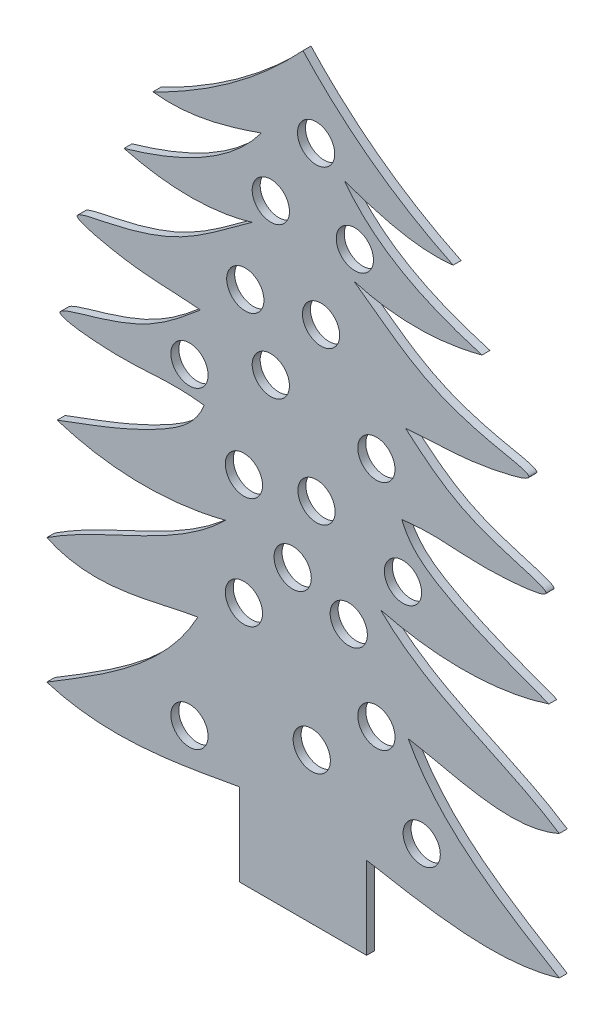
ISO-10303-21;
HEADER;
FILE_DESCRIPTION(('STEP AP214'),'2;1');
FILE_NAME('part.step','',(''),(''),'','','');
FILE_SCHEMA(('AUTOMOTIVE_DESIGN { 1 0 10303 214 1 1 1 1 }'));
ENDSEC;
DATA;
#1=APPLICATION_CONTEXT('core data for automotive mechanical design processes');
#2=APPLICATION_PROTOCOL_DEFINITION('international standard','automotive_design',2000,#1);
#3=PRODUCT_CONTEXT('',#1,'mechanical');
#4=PRODUCT('Part','Part','',(#3));
#5=PRODUCT_RELATED_PRODUCT_CATEGORY('part','',(#4));
#6=PRODUCT_DEFINITION_FORMATION('','',#4);
#7=PRODUCT_DEFINITION_CONTEXT('part definition',#1,'design');
#8=PRODUCT_DEFINITION('design','',#6,#7);
#9=PRODUCT_DEFINITION_SHAPE('','',#8);
#10=(LENGTH_UNIT() NAMED_UNIT(*) SI_UNIT(.MILLI.,.METRE.));
#11=(NAMED_UNIT(*) PLANE_ANGLE_UNIT() SI_UNIT($,.RADIAN.));
#12=(NAMED_UNIT(*) SI_UNIT($,.STERADIAN.) SOLID_ANGLE_UNIT());
#13=UNCERTAINTY_MEASURE_WITH_UNIT(LENGTH_MEASURE(1.E-05),#10,'distance_accuracy_value','');
#14=(GEOMETRIC_REPRESENTATION_CONTEXT(3) GLOBAL_UNCERTAINTY_ASSIGNED_CONTEXT((#13)) GLOBAL_UNIT_ASSIGNED_CONTEXT((#10,
#11,#12)) REPRESENTATION_CONTEXT('',''));
#15=CARTESIAN_POINT('',(0.,0.,0.));
#16=DIRECTION('',(0.,0.,1.));
#17=DIRECTION('',(1.,0.,0.));
#18=AXIS2_PLACEMENT_3D('',#15,#16,#17);
#19=CARTESIAN_POINT('',(156.464642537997,247.550346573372,-3.));
#20=CARTESIAN_POINT('',(124.058750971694,263.140938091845,-3.));
#21=CARTESIAN_POINT('',(100.,289.194426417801,-3.));
#22=B_SPLINE_CURVE_WITH_KNOTS('',2,(#19,#20,#21),.UNSPECIFIED.,.F.,.F.,(3,3),(0.,1.),.UNSPECIFIED.);
#23=DIRECTION('',(0.,0.,1.));
#24=VECTOR('',#23,1.);
#25=SURFACE_OF_LINEAR_EXTRUSION('',#22,#24);
#26=CARTESIAN_POINT('',(156.464642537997,247.550346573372,0.));
#27=CARTESIAN_POINT('',(124.058750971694,263.140938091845,0.));
#28=CARTESIAN_POINT('',(100.,289.194426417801,0.));
#29=B_SPLINE_CURVE_WITH_KNOTS('',2,(#26,#27,#28),.UNSPECIFIED.,.F.,.F.,(3,3),(0.,1.),.UNSPECIFIED.);
#30=CARTESIAN_POINT('',(156.464642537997,247.550346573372,0.));
#31=VERTEX_POINT('',#30);
#32=CARTESIAN_POINT('',(100.,289.194426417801,0.));
#33=VERTEX_POINT('',#32);
#34=EDGE_CURVE('E441',#31,#33,#29,.T.);
#35=ORIENTED_EDGE('',*,*,#34,.F.);
#36=DIRECTION('',(0.,0.,1.));
#37=VECTOR('',#36,1.);
#38=CARTESIAN_POINT('',(156.464642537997,247.550346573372,-3.));
#39=LINE('',#38,#37);
#40=CARTESIAN_POINT('',(156.464642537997,247.550346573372,-3.));
#41=VERTEX_POINT('',#40);
#42=EDGE_CURVE('E11',#41,#31,#39,.T.);
#43=ORIENTED_EDGE('',*,*,#42,.F.);
#44=CARTESIAN_POINT('',(100.,289.194426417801,-3.));
#45=VERTEX_POINT('',#44);
#46=EDGE_CURVE('E544',#41,#45,#22,.T.);
#47=ORIENTED_EDGE('',*,*,#46,.T.);
#48=DIRECTION('',(0.,0.,1.));
#49=VECTOR('',#48,1.);
#50=CARTESIAN_POINT('',(100.,289.194426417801,-3.));
#51=LINE('',#50,#49);
#52=EDGE_CURVE('E40',#45,#33,#51,.T.);
#53=ORIENTED_EDGE('',*,*,#52,.T.);
#54=EDGE_LOOP('',(#35,#43,#47,#53));
#55=FACE_BOUND('',#54,.T.);
#56=ADVANCED_FACE('F36',(#55),#25,.T.);
#57=CARTESIAN_POINT('',(115.688147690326,254.491026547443,-3.));
#58=CARTESIAN_POINT('',(128.764144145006,249.987117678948,-3.));
#59=CARTESIAN_POINT('',(142.470415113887,245.863856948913,-3.));
#60=CARTESIAN_POINT('',(156.464642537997,247.550346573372,-3.));
#61=B_SPLINE_CURVE_WITH_KNOTS('',3,(#57,#58,#59,#60),.UNSPECIFIED.,.F.,.F.,(4,4),(0.,1.),.UNSPECIFIED.);
#62=DIRECTION('',(0.,0.,1.));
#63=VECTOR('',#62,1.);
#64=SURFACE_OF_LINEAR_EXTRUSION('',#61,#63);
#65=CARTESIAN_POINT('',(115.688147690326,254.491026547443,0.));
#66=CARTESIAN_POINT('',(128.764144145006,249.987117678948,0.));
#67=CARTESIAN_POINT('',(142.470415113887,245.863856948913,0.));
#68=CARTESIAN_POINT('',(156.464642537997,247.550346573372,0.));
#69=B_SPLINE_CURVE_WITH_KNOTS('',3,(#65,#66,#67,#68),.UNSPECIFIED.,.F.,.F.,(4,4),(0.,1.),.UNSPECIFIED.);
#70=CARTESIAN_POINT('',(115.688147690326,254.491026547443,0.));
#71=VERTEX_POINT('',#70);
#72=EDGE_CURVE('E543',#71,#31,#69,.T.);
#73=ORIENTED_EDGE('',*,*,#72,.F.);
#74=DIRECTION('',(0.,0.,1.));
#75=VECTOR('',#74,1.);
#76=CARTESIAN_POINT('',(115.688147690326,254.491026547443,-3.));
#77=LINE('',#76,#75);
#78=CARTESIAN_POINT('',(115.688147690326,254.491026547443,-3.));
#79=VERTEX_POINT('',#78);
#80=EDGE_CURVE('E46',#79,#71,#77,.T.);
#81=ORIENTED_EDGE('',*,*,#80,.F.);
#82=EDGE_CURVE('E238',#79,#41,#61,.T.);
#83=ORIENTED_EDGE('',*,*,#82,.T.);
#84=ORIENTED_EDGE('',*,*,#42,.T.);
#85=EDGE_LOOP('',(#73,#81,#83,#84));
#86=FACE_BOUND('',#85,.T.);
#87=ADVANCED_FACE('F448',(#86),#64,.T.);
#88=CARTESIAN_POINT('',(167.309454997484,223.6917591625,-3.));
#89=CARTESIAN_POINT('',(148.105713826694,229.223285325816,-3.));
#90=CARTESIAN_POINT('',(127.991768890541,237.882357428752,-3.));
#91=CARTESIAN_POINT('',(115.688147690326,254.491026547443,-3.));
#92=B_SPLINE_CURVE_WITH_KNOTS('',3,(#88,#89,#90,#91),.UNSPECIFIED.,.F.,.F.,(4,4),(0.,1.),.UNSPECIFIED.);
#93=DIRECTION('',(0.,0.,1.));
#94=VECTOR('',#93,1.);
#95=SURFACE_OF_LINEAR_EXTRUSION('',#92,#94);
#96=CARTESIAN_POINT('',(167.309454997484,223.6917591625,0.));
#97=CARTESIAN_POINT('',(148.105713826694,229.223285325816,0.));
#98=CARTESIAN_POINT('',(127.991768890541,237.882357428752,0.));
#99=CARTESIAN_POINT('',(115.688147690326,254.491026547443,0.));
#100=B_SPLINE_CURVE_WITH_KNOTS('',3,(#96,#97,#98,#99),.UNSPECIFIED.,.F.,.F.,(4,4),(0.,1.),.UNSPECIFIED.);
#101=CARTESIAN_POINT('',(167.309454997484,223.6917591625,0.));
#102=VERTEX_POINT('',#101);
#103=EDGE_CURVE('E225',#102,#71,#100,.T.);
#104=ORIENTED_EDGE('',*,*,#103,.F.);
#105=DIRECTION('',(0.,0.,1.));
#106=VECTOR('',#105,1.);
#107=CARTESIAN_POINT('',(167.309454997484,223.6917591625,-3.));
#108=LINE('',#107,#106);
#109=CARTESIAN_POINT('',(167.309454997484,223.6917591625,-3.));
#110=VERTEX_POINT('',#109);
#111=EDGE_CURVE('E220',#110,#102,#108,.T.);
#112=ORIENTED_EDGE('',*,*,#111,.F.);
#113=EDGE_CURVE('E223',#110,#79,#92,.T.);
#114=ORIENTED_EDGE('',*,*,#113,.T.);
#115=ORIENTED_EDGE('',*,*,#80,.T.);
#116=EDGE_LOOP('',(#104,#112,#114,#115));
#117=FACE_BOUND('',#116,.T.);
#118=ADVANCED_FACE('F222',(#117),#95,.T.);
#119=CARTESIAN_POINT('',(119.158487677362,223.6917591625,-3.));
#120=CARTESIAN_POINT('',(134.697637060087,219.010695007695,-3.));
#121=CARTESIAN_POINT('',(151.725781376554,219.478381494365,-3.));
#122=CARTESIAN_POINT('',(167.309454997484,223.6917591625,-3.));
#123=B_SPLINE_CURVE_WITH_KNOTS('',3,(#119,#120,#121,#122),.UNSPECIFIED.,.F.,.F.,(4,4),(0.,1.),.UNSPECIFIED.);
#124=DIRECTION('',(0.,0.,1.));
#125=VECTOR('',#124,1.);
#126=SURFACE_OF_LINEAR_EXTRUSION('',#123,#125);
#127=CARTESIAN_POINT('',(119.158487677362,223.6917591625,0.));
#128=CARTESIAN_POINT('',(134.697637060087,219.010695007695,0.));
#129=CARTESIAN_POINT('',(151.725781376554,219.478381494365,0.));
#130=CARTESIAN_POINT('',(167.309454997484,223.6917591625,0.));
#131=B_SPLINE_CURVE_WITH_KNOTS('',3,(#127,#128,#129,#130),.UNSPECIFIED.,.F.,.F.,(4,4),(0.,1.),.UNSPECIFIED.);
#132=CARTESIAN_POINT('',(119.158487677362,223.6917591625,0.));
#133=VERTEX_POINT('',#132);
#134=EDGE_CURVE('E547',#133,#102,#131,.T.);
#135=ORIENTED_EDGE('',*,*,#134,.F.);
#136=DIRECTION('',(0.,0.,1.));
#137=VECTOR('',#136,1.);
#138=CARTESIAN_POINT('',(119.158487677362,223.6917591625,-3.));
#139=LINE('',#138,#137);
#140=CARTESIAN_POINT('',(119.158487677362,223.6917591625,-3.));
#141=VERTEX_POINT('',#140);
#142=EDGE_CURVE('E230',#141,#133,#139,.T.);
#143=ORIENTED_EDGE('',*,*,#142,.F.);
#144=EDGE_CURVE('E236',#141,#110,#123,.T.);
#145=ORIENTED_EDGE('',*,*,#144,.T.);
#146=ORIENTED_EDGE('',*,*,#111,.T.);
#147=EDGE_LOOP('',(#135,#143,#145,#146));
#148=FACE_BOUND('',#147,.T.);
#149=ADVANCED_FACE('F240',(#148),#126,.T.);
#150=CARTESIAN_POINT('',(138.581076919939,185.433134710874,-3.));
#151=CARTESIAN_POINT('',(151.185487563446,186.688084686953,-3.));
#152=CARTESIAN_POINT('',(160.92351611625,185.484049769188,-3.));
#153=CARTESIAN_POINT('',(191.008109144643,193.127473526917,-3.));
#154=CARTESIAN_POINT('',(147.515578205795,200.577423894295,-3.));
#155=CARTESIAN_POINT('',(138.181407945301,210.116658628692,-3.));
#156=CARTESIAN_POINT('',(119.158487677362,223.6917591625,-3.));
#157=B_SPLINE_CURVE_WITH_KNOTS('',3,(#150,#151,#152,#153,#154,#155,#156),.UNSPECIFIED.,.F.,.F.,
(4,1,1,1,4),(0.,0.294335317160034,0.392110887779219,0.492424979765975,1.),.UNSPECIFIED.);
#158=DIRECTION('',(0.,0.,1.));
#159=VECTOR('',#158,1.);
#160=SURFACE_OF_LINEAR_EXTRUSION('',#157,#159);
#161=CARTESIAN_POINT('',(138.581076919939,185.433134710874,0.));
#162=CARTESIAN_POINT('',(151.185487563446,186.688084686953,0.));
#163=CARTESIAN_POINT('',(160.92351611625,185.484049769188,0.));
#164=CARTESIAN_POINT('',(191.008109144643,193.127473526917,0.));
#165=CARTESIAN_POINT('',(147.515578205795,200.577423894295,0.));
#166=CARTESIAN_POINT('',(138.181407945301,210.116658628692,0.));
#167=CARTESIAN_POINT('',(119.158487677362,223.6917591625,0.));
#168=B_SPLINE_CURVE_WITH_KNOTS('',3,(#161,#162,#163,#164,#165,#166,#167),.UNSPECIFIED.,.F.,.F.,
(4,1,1,1,4),(0.,0.294335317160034,0.392110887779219,0.492424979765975,1.),.UNSPECIFIED.);
#169=CARTESIAN_POINT('',(138.581076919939,185.433134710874,0.));
#170=VERTEX_POINT('',#169);
#171=EDGE_CURVE('E623',#170,#133,#168,.T.);
#172=ORIENTED_EDGE('',*,*,#171,.F.);
#173=DIRECTION('',(0.,0.,1.));
#174=VECTOR('',#173,1.);
#175=CARTESIAN_POINT('',(138.581076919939,185.433134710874,-3.));
#176=LINE('',#175,#174);
#177=CARTESIAN_POINT('',(138.581076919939,185.433134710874,-3.));
#178=VERTEX_POINT('',#177);
#179=EDGE_CURVE('E560',#178,#170,#176,.T.);
#180=ORIENTED_EDGE('',*,*,#179,.F.);
#181=EDGE_CURVE('E241',#178,#141,#157,.T.);
#182=ORIENTED_EDGE('',*,*,#181,.T.);
#183=ORIENTED_EDGE('',*,*,#142,.T.);
#184=EDGE_LOOP('',(#172,#180,#182,#183));
#185=FACE_BOUND('',#184,.T.);
#186=ADVANCED_FACE('F263',(#185),#160,.T.);
#187=CARTESIAN_POINT('',(137.170095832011,155.093409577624,-3.));
#188=CARTESIAN_POINT('',(152.374927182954,156.907095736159,-3.));
#189=CARTESIAN_POINT('',(160.228014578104,153.348614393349,-3.));
#190=CARTESIAN_POINT('',(200.261833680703,157.413614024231,-3.));
#191=CARTESIAN_POINT('',(161.28633559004,167.291079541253,-3.));
#192=CARTESIAN_POINT('',(151.618011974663,174.279022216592,-3.));
#193=CARTESIAN_POINT('',(138.581076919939,185.433134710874,-3.));
#194=B_SPLINE_CURVE_WITH_KNOTS('',3,(#187,#188,#189,#190,#191,#192,#193),.UNSPECIFIED.,.F.,.F.,
(4,1,1,1,4),(0.,0.313361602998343,0.47691265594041,0.604126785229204,1.),.UNSPECIFIED.);
#195=DIRECTION('',(0.,0.,1.));
#196=VECTOR('',#195,1.);
#197=SURFACE_OF_LINEAR_EXTRUSION('',#194,#196);
#198=CARTESIAN_POINT('',(137.170095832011,155.093409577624,0.));
#199=CARTESIAN_POINT('',(152.374927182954,156.907095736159,0.));
#200=CARTESIAN_POINT('',(160.228014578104,153.348614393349,0.));
#201=CARTESIAN_POINT('',(200.261833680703,157.413614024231,0.));
#202=CARTESIAN_POINT('',(161.28633559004,167.291079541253,0.));
#203=CARTESIAN_POINT('',(151.618011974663,174.279022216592,0.));
#204=CARTESIAN_POINT('',(138.581076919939,185.433134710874,0.));
#205=B_SPLINE_CURVE_WITH_KNOTS('',3,(#198,#199,#200,#201,#202,#203,#204),.UNSPECIFIED.,.F.,.F.,
(4,1,1,1,4),(0.,0.313361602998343,0.47691265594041,0.604126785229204,1.),.UNSPECIFIED.);
#206=CARTESIAN_POINT('',(137.170095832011,155.093409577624,0.));
#207=VERTEX_POINT('',#206);
#208=EDGE_CURVE('E615',#207,#170,#205,.T.);
#209=ORIENTED_EDGE('',*,*,#208,.F.);
#210=DIRECTION('',(0.,0.,1.));
#211=VECTOR('',#210,1.);
#212=CARTESIAN_POINT('',(137.170095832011,155.093409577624,-3.));
#213=LINE('',#212,#211);
#214=CARTESIAN_POINT('',(137.170095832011,155.093409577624,-3.));
#215=VERTEX_POINT('',#214);
#216=EDGE_CURVE('E562',#215,#207,#213,.T.);
#217=ORIENTED_EDGE('',*,*,#216,.F.);
#218=EDGE_CURVE('E243',#215,#178,#194,.T.);
#219=ORIENTED_EDGE('',*,*,#218,.T.);
#220=ORIENTED_EDGE('',*,*,#179,.T.);
#221=EDGE_LOOP('',(#209,#217,#219,#220));
#222=FACE_BOUND('',#221,.T.);
#223=ADVANCED_FACE('F267',(#222),#197,.T.);
#224=CARTESIAN_POINT('',(192.469419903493,122.622758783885,-3.));
#225=CARTESIAN_POINT('',(179.145310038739,127.607519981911,-3.));
#226=CARTESIAN_POINT('',(158.534559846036,134.882349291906,-3.));
#227=CARTESIAN_POINT('',(140.12191089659,147.378971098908,-3.));
#228=CARTESIAN_POINT('',(137.170095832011,155.093409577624,-3.));
#229=B_SPLINE_CURVE_WITH_KNOTS('',3,(#224,#225,#226,#227,#228),.UNSPECIFIED.,.F.,.F.,(4,1,4),
(0.,0.650892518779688,1.),.UNSPECIFIED.);
#230=DIRECTION('',(0.,0.,1.));
#231=VECTOR('',#230,1.);
#232=SURFACE_OF_LINEAR_EXTRUSION('',#229,#231);
#233=CARTESIAN_POINT('',(192.469419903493,122.622758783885,0.));
#234=CARTESIAN_POINT('',(179.145310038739,127.607519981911,0.));
#235=CARTESIAN_POINT('',(158.534559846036,134.882349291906,0.));
#236=CARTESIAN_POINT('',(140.12191089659,147.378971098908,0.));
#237=CARTESIAN_POINT('',(137.170095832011,155.093409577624,0.));
#238=B_SPLINE_CURVE_WITH_KNOTS('',3,(#233,#234,#235,#236,#237),.UNSPECIFIED.,.F.,.F.,(4,1,4),
(0.,0.650892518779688,1.),.UNSPECIFIED.);
#239=CARTESIAN_POINT('',(192.469419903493,122.622758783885,0.));
#240=VERTEX_POINT('',#239);
#241=EDGE_CURVE('E607',#240,#207,#238,.T.);
#242=ORIENTED_EDGE('',*,*,#241,.F.);
#243=DIRECTION('',(0.,0.,1.));
#244=VECTOR('',#243,1.);
#245=CARTESIAN_POINT('',(192.469419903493,122.622758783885,-3.));
#246=LINE('',#245,#244);
#247=CARTESIAN_POINT('',(192.469419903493,122.622758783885,-3.));
#248=VERTEX_POINT('',#247);
#249=EDGE_CURVE('E564',#248,#240,#246,.T.);
#250=ORIENTED_EDGE('',*,*,#249,.F.);
#251=EDGE_CURVE('E279',#248,#215,#229,.T.);
#252=ORIENTED_EDGE('',*,*,#251,.T.);
#253=ORIENTED_EDGE('',*,*,#216,.T.);
#254=EDGE_LOOP('',(#242,#250,#252,#253));
#255=FACE_BOUND('',#254,.T.);
#256=ADVANCED_FACE('F271',(#255),#232,.T.);
#257=CARTESIAN_POINT('',(129.13571514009,121.647713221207,-3.));
#258=CARTESIAN_POINT('',(149.786480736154,116.309571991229,-3.));
#259=CARTESIAN_POINT('',(172.050862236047,116.031262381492,-3.));
#260=CARTESIAN_POINT('',(192.469419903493,122.622758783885,-3.));
#261=B_SPLINE_CURVE_WITH_KNOTS('',3,(#257,#258,#259,#260),.UNSPECIFIED.,.F.,.F.,(4,4),(0.,1.),.UNSPECIFIED.);
#262=DIRECTION('',(0.,0.,1.));
#263=VECTOR('',#262,1.);
#264=SURFACE_OF_LINEAR_EXTRUSION('',#261,#263);
#265=CARTESIAN_POINT('',(129.13571514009,121.647713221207,0.));
#266=CARTESIAN_POINT('',(149.786480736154,116.309571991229,0.));
#267=CARTESIAN_POINT('',(172.050862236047,116.031262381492,0.));
#268=CARTESIAN_POINT('',(192.469419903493,122.622758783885,0.));
#269=B_SPLINE_CURVE_WITH_KNOTS('',3,(#265,#266,#267,#268),.UNSPECIFIED.,.F.,.F.,(4,4),(0.,1.),.UNSPECIFIED.);
#270=CARTESIAN_POINT('',(129.13571514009,121.647713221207,0.));
#271=VERTEX_POINT('',#270);
#272=EDGE_CURVE('E599',#271,#240,#269,.T.);
#273=ORIENTED_EDGE('',*,*,#272,.F.);
#274=DIRECTION('',(0.,0.,1.));
#275=VECTOR('',#274,1.);
#276=CARTESIAN_POINT('',(129.13571514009,121.647713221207,-3.));
#277=LINE('',#276,#275);
#278=CARTESIAN_POINT('',(129.13571514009,121.647713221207,-3.));
#279=VERTEX_POINT('',#278);
#280=EDGE_CURVE('E566',#279,#271,#277,.T.);
#281=ORIENTED_EDGE('',*,*,#280,.F.);
#282=EDGE_CURVE('E288',#279,#248,#261,.T.);
#283=ORIENTED_EDGE('',*,*,#282,.T.);
#284=ORIENTED_EDGE('',*,*,#249,.T.);
#285=EDGE_LOOP('',(#273,#281,#283,#284));
#286=FACE_BOUND('',#285,.T.);
#287=ADVANCED_FACE('F305',(#286),#264,.T.);
#288=CARTESIAN_POINT('',(196.373552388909,82.4025058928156,-3.));
#289=CARTESIAN_POINT('',(174.589965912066,96.6989716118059,-3.));
#290=CARTESIAN_POINT('',(148.092142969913,102.8592487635,-3.));
#291=CARTESIAN_POINT('',(129.13571514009,121.647713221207,-3.));
#292=B_SPLINE_CURVE_WITH_KNOTS('',3,(#288,#289,#290,#291),.UNSPECIFIED.,.F.,.F.,(4,4),(0.,1.),.UNSPECIFIED.);
#293=DIRECTION('',(0.,0.,1.));
#294=VECTOR('',#293,1.);
#295=SURFACE_OF_LINEAR_EXTRUSION('',#292,#294);
#296=CARTESIAN_POINT('',(196.373552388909,82.4025058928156,0.));
#297=CARTESIAN_POINT('',(174.589965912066,96.6989716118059,0.));
#298=CARTESIAN_POINT('',(148.092142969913,102.8592487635,0.));
#299=CARTESIAN_POINT('',(129.13571514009,121.647713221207,0.));
#300=B_SPLINE_CURVE_WITH_KNOTS('',3,(#296,#297,#298,#299),.UNSPECIFIED.,.F.,.F.,(4,4),(0.,1.),.UNSPECIFIED.);
#301=CARTESIAN_POINT('',(196.373552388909,82.4025058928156,0.));
#302=VERTEX_POINT('',#301);
#303=EDGE_CURVE('E577',#302,#271,#300,.T.);
#304=ORIENTED_EDGE('',*,*,#303,.F.);
#305=DIRECTION('',(0.,0.,1.));
#306=VECTOR('',#305,1.);
#307=CARTESIAN_POINT('',(196.373552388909,82.4025058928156,-3.));
#308=LINE('',#307,#306);
#309=CARTESIAN_POINT('',(196.373552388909,82.4025058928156,-3.));
#310=VERTEX_POINT('',#309);
#311=EDGE_CURVE('E568',#310,#302,#308,.T.);
#312=ORIENTED_EDGE('',*,*,#311,.F.);
#313=EDGE_CURVE('E297',#310,#279,#292,.T.);
#314=ORIENTED_EDGE('',*,*,#313,.T.);
#315=ORIENTED_EDGE('',*,*,#280,.T.);
#316=EDGE_LOOP('',(#304,#312,#314,#315));
#317=FACE_BOUND('',#316,.T.);
#318=ADVANCED_FACE('F308',(#317),#295,.T.);
#319=CARTESIAN_POINT('',(139.546735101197,84.9228403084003,-3.));
#320=CARTESIAN_POINT('',(157.616347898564,81.8236914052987,-3.));
#321=CARTESIAN_POINT('',(178.304613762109,74.1752878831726,-3.));
#322=CARTESIAN_POINT('',(196.373552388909,82.4025058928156,-3.));
#323=B_SPLINE_CURVE_WITH_KNOTS('',3,(#319,#320,#321,#322),.UNSPECIFIED.,.F.,.F.,(4,4),(0.,1.),.UNSPECIFIED.);
#324=DIRECTION('',(0.,0.,1.));
#325=VECTOR('',#324,1.);
#326=SURFACE_OF_LINEAR_EXTRUSION('',#323,#325);
#327=CARTESIAN_POINT('',(139.546735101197,84.9228403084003,0.));
#328=CARTESIAN_POINT('',(157.616347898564,81.8236914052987,0.));
#329=CARTESIAN_POINT('',(178.304613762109,74.1752878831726,0.));
#330=CARTESIAN_POINT('',(196.373552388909,82.4025058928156,0.));
#331=B_SPLINE_CURVE_WITH_KNOTS('',3,(#327,#328,#329,#330),.UNSPECIFIED.,.F.,.F.,(4,4),(0.,1.),.UNSPECIFIED.);
#332=CARTESIAN_POINT('',(139.546735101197,84.9228403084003,0.));
#333=VERTEX_POINT('',#332);
#334=EDGE_CURVE('E574',#333,#302,#331,.T.);
#335=ORIENTED_EDGE('',*,*,#334,.F.);
#336=DIRECTION('',(0.,0.,1.));
#337=VECTOR('',#336,1.);
#338=CARTESIAN_POINT('',(139.546735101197,84.9228403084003,-3.));
#339=LINE('',#338,#337);
#340=CARTESIAN_POINT('',(139.546735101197,84.9228403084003,-3.));
#341=VERTEX_POINT('',#340);
#342=EDGE_CURVE('E407',#341,#333,#339,.T.);
#343=ORIENTED_EDGE('',*,*,#342,.F.);
#344=EDGE_CURVE('E320',#341,#310,#323,.T.);
#345=ORIENTED_EDGE('',*,*,#344,.T.);
#346=ORIENTED_EDGE('',*,*,#311,.T.);
#347=EDGE_LOOP('',(#335,#343,#345,#346));
#348=FACE_BOUND('',#347,.T.);
#349=ADVANCED_FACE('F312',(#348),#326,.T.);
#350=CARTESIAN_POINT('',(196.373552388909,35.3372168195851,-3.));
#351=CARTESIAN_POINT('',(174.926267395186,48.3991768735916,-3.));
#352=CARTESIAN_POINT('',(151.850811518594,61.9060308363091,-3.));
#353=CARTESIAN_POINT('',(139.546735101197,84.9228403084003,-3.));
#354=B_SPLINE_CURVE_WITH_KNOTS('',3,(#350,#351,#352,#353),.UNSPECIFIED.,.F.,.F.,(4,4),(0.,1.),.UNSPECIFIED.);
#355=DIRECTION('',(0.,0.,1.));
#356=VECTOR('',#355,1.);
#357=SURFACE_OF_LINEAR_EXTRUSION('',#354,#356);
#358=CARTESIAN_POINT('',(196.373552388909,35.3372168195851,0.));
#359=CARTESIAN_POINT('',(174.926267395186,48.3991768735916,0.));
#360=CARTESIAN_POINT('',(151.850811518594,61.9060308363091,0.));
#361=CARTESIAN_POINT('',(139.546735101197,84.9228403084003,0.));
#362=B_SPLINE_CURVE_WITH_KNOTS('',3,(#358,#359,#360,#361),.UNSPECIFIED.,.F.,.F.,(4,4),(0.,1.),.UNSPECIFIED.);
#363=CARTESIAN_POINT('',(196.373552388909,35.3372168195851,0.));
#364=VERTEX_POINT('',#363);
#365=EDGE_CURVE('E572',#364,#333,#362,.T.);
#366=ORIENTED_EDGE('',*,*,#365,.F.);
#367=DIRECTION('',(0.,0.,1.));
#368=VECTOR('',#367,1.);
#369=CARTESIAN_POINT('',(196.373552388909,35.3372168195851,-3.));
#370=LINE('',#369,#368);
#371=CARTESIAN_POINT('',(196.373552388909,35.3372168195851,-3.));
#372=VERTEX_POINT('',#371);
#373=EDGE_CURVE('E401',#372,#364,#370,.T.);
#374=ORIENTED_EDGE('',*,*,#373,.F.);
#375=EDGE_CURVE('E325',#372,#341,#354,.T.);
#376=ORIENTED_EDGE('',*,*,#375,.T.);
#377=ORIENTED_EDGE('',*,*,#342,.T.);
#378=EDGE_LOOP('',(#366,#374,#376,#377));
#379=FACE_BOUND('',#378,.T.);
#380=ADVANCED_FACE('F316',(#379),#357,.T.);
#381=CARTESIAN_POINT('',(123.922171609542,37.4584098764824,-3.));
#382=CARTESIAN_POINT('',(147.583548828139,33.2081584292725,-3.));
#383=CARTESIAN_POINT('',(172.724040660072,28.1890735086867,-3.));
#384=CARTESIAN_POINT('',(196.373552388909,35.3372168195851,-3.));
#385=B_SPLINE_CURVE_WITH_KNOTS('',3,(#381,#382,#383,#384),.UNSPECIFIED.,.F.,.F.,(4,4),(0.,1.),.UNSPECIFIED.);
#386=DIRECTION('',(0.,0.,1.));
#387=VECTOR('',#386,1.);
#388=SURFACE_OF_LINEAR_EXTRUSION('',#385,#387);
#389=CARTESIAN_POINT('',(123.922171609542,37.4584098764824,0.));
#390=CARTESIAN_POINT('',(147.583548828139,33.2081584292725,0.));
#391=CARTESIAN_POINT('',(172.724040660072,28.1890735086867,0.));
#392=CARTESIAN_POINT('',(196.373552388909,35.3372168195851,0.));
#393=B_SPLINE_CURVE_WITH_KNOTS('',3,(#389,#390,#391,#392),.UNSPECIFIED.,.F.,.F.,(4,4),(0.,1.),.UNSPECIFIED.);
#394=CARTESIAN_POINT('',(123.922171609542,37.4584098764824,0.));
#395=VERTEX_POINT('',#394);
#396=EDGE_CURVE('E404',#395,#364,#393,.T.);
#397=ORIENTED_EDGE('',*,*,#396,.F.);
#398=DIRECTION('',(0.,0.,1.));
#399=VECTOR('',#398,1.);
#400=CARTESIAN_POINT('',(123.922171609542,37.4584098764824,-3.));
#401=LINE('',#400,#399);
#402=CARTESIAN_POINT('',(123.922171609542,37.4584098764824,-3.));
#403=VERTEX_POINT('',#402);
#404=EDGE_CURVE('E394',#403,#395,#401,.T.);
#405=ORIENTED_EDGE('',*,*,#404,.F.);
#406=EDGE_CURVE('E334',#403,#372,#385,.T.);
#407=ORIENTED_EDGE('',*,*,#406,.T.);
#408=ORIENTED_EDGE('',*,*,#373,.T.);
#409=EDGE_LOOP('',(#397,#405,#407,#408));
#410=FACE_BOUND('',#409,.T.);
#411=ADVANCED_FACE('F348',(#410),#388,.T.);
#412=CARTESIAN_POINT('',(123.922171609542,37.4584098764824,-3.));
#413=DIRECTION('',(1.,0.,0.));
#414=DIRECTION('',(0.,0.,-1.));
#415=AXIS2_PLACEMENT_3D('',#412,#413,#414);
#416=PLANE('',#415);
#417=DIRECTION('',(0.,1.,0.));
#418=VECTOR('',#417,1.);
#419=CARTESIAN_POINT('',(123.922171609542,37.4584098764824,0.));
#420=LINE('',#419,#418);
#421=CARTESIAN_POINT('',(123.922171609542,6.47586588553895,0.));
#422=VERTEX_POINT('',#421);
#423=EDGE_CURVE('E580',#422,#395,#420,.T.);
#424=ORIENTED_EDGE('',*,*,#423,.F.);
#425=DIRECTION('',(0.,0.,1.));
#426=VECTOR('',#425,1.);
#427=CARTESIAN_POINT('',(123.922171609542,6.47586588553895,-3.));
#428=LINE('',#427,#426);
#429=CARTESIAN_POINT('',(123.922171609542,6.47586588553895,-3.));
#430=VERTEX_POINT('',#429);
#431=EDGE_CURVE('E396',#430,#422,#428,.T.);
#432=ORIENTED_EDGE('',*,*,#431,.F.);
#433=DIRECTION('',(0.,1.,0.));
#434=VECTOR('',#433,1.);
#435=CARTESIAN_POINT('',(123.922171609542,37.4584098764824,-3.));
#436=LINE('',#435,#434);
#437=EDGE_CURVE('E343',#430,#403,#436,.T.);
#438=ORIENTED_EDGE('',*,*,#437,.T.);
#439=ORIENTED_EDGE('',*,*,#404,.T.);
#440=EDGE_LOOP('',(#424,#432,#438,#439));
#441=FACE_BOUND('',#440,.T.);
#442=ADVANCED_FACE('F351',(#441),#416,.T.);
#443=CARTESIAN_POINT('',(76.0778283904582,6.47586588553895,-3.));
#444=DIRECTION('',(0.,-1.,0.));
#445=DIRECTION('',(0.,0.,-1.));
#446=AXIS2_PLACEMENT_3D('',#443,#444,#445);
#447=PLANE('',#446);
#448=DIRECTION('',(1.,0.,0.));
#449=VECTOR('',#448,1.);
#450=CARTESIAN_POINT('',(76.0778283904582,6.47586588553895,0.));
#451=LINE('',#450,#449);
#452=CARTESIAN_POINT('',(76.0778283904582,6.47586588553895,0.));
#453=VERTEX_POINT('',#452);
#454=EDGE_CURVE('E1181',#453,#422,#451,.T.);
#455=ORIENTED_EDGE('',*,*,#454,.F.);
#456=DIRECTION('',(0.,0.,1.));
#457=VECTOR('',#456,1.);
#458=CARTESIAN_POINT('',(76.0778283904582,6.47586588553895,-3.));
#459=LINE('',#458,#457);
#460=CARTESIAN_POINT('',(76.0778283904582,6.47586588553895,-3.));
#461=VERTEX_POINT('',#460);
#462=EDGE_CURVE('E409',#461,#453,#459,.T.);
#463=ORIENTED_EDGE('',*,*,#462,.F.);
#464=DIRECTION('',(1.,0.,0.));
#465=VECTOR('',#464,1.);
#466=CARTESIAN_POINT('',(76.0778283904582,6.47586588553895,-3.));
#467=LINE('',#466,#465);
#468=EDGE_CURVE('E388',#461,#430,#467,.T.);
#469=ORIENTED_EDGE('',*,*,#468,.T.);
#470=ORIENTED_EDGE('',*,*,#431,.T.);
#471=EDGE_LOOP('',(#455,#463,#469,#470));
#472=FACE_BOUND('',#471,.T.);
#473=ADVANCED_FACE('F355',(#472),#447,.T.);
#474=CARTESIAN_POINT('',(76.0778283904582,37.4584098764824,-3.));
#475=DIRECTION('',(-1.,0.,0.));
#476=DIRECTION('',(0.,0.,1.));
#477=AXIS2_PLACEMENT_3D('',#474,#475,#476);
#478=PLANE('',#477);
#479=DIRECTION('',(0.,-1.,0.));
#480=VECTOR('',#479,1.);
#481=CARTESIAN_POINT('',(76.0778283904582,37.4584098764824,0.));
#482=LINE('',#481,#480);
#483=CARTESIAN_POINT('',(76.0778283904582,37.4584098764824,0.));
#484=VERTEX_POINT('',#483);
#485=EDGE_CURVE('E1156',#484,#453,#482,.T.);
#486=ORIENTED_EDGE('',*,*,#485,.F.);
#487=DIRECTION('',(0.,0.,1.));
#488=VECTOR('',#487,1.);
#489=CARTESIAN_POINT('',(76.0778283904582,37.4584098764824,-3.));
#490=LINE('',#489,#488);
#491=CARTESIAN_POINT('',(76.0778283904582,37.4584098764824,-3.));
#492=VERTEX_POINT('',#491);
#493=EDGE_CURVE('E414',#492,#484,#490,.T.);
#494=ORIENTED_EDGE('',*,*,#493,.F.);
#495=DIRECTION('',(0.,-1.,0.));
#496=VECTOR('',#495,1.);
#497=CARTESIAN_POINT('',(76.0778283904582,37.4584098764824,-3.));
#498=LINE('',#497,#496);
#499=EDGE_CURVE('E378',#492,#461,#498,.T.);
#500=ORIENTED_EDGE('',*,*,#499,.T.);
#501=ORIENTED_EDGE('',*,*,#462,.T.);
#502=EDGE_LOOP('',(#486,#494,#500,#501));
#503=FACE_BOUND('',#502,.T.);
#504=ADVANCED_FACE('F359',(#503),#478,.T.);
#505=CARTESIAN_POINT('',(3.6264476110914,35.3372168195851,-3.));
#506=CARTESIAN_POINT('',(27.2759593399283,28.1890735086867,-3.));
#507=CARTESIAN_POINT('',(52.4164511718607,33.2081584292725,-3.));
#508=CARTESIAN_POINT('',(76.0778283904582,37.4584098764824,-3.));
#509=B_SPLINE_CURVE_WITH_KNOTS('',3,(#505,#506,#507,#508),.UNSPECIFIED.,.F.,.F.,(4,4),(0.,1.),.UNSPECIFIED.);
#510=DIRECTION('',(0.,0.,1.));
#511=VECTOR('',#510,1.);
#512=SURFACE_OF_LINEAR_EXTRUSION('',#509,#511);
#513=CARTESIAN_POINT('',(3.6264476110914,35.3372168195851,0.));
#514=CARTESIAN_POINT('',(27.2759593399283,28.1890735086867,0.));
#515=CARTESIAN_POINT('',(52.4164511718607,33.2081584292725,0.));
#516=CARTESIAN_POINT('',(76.0778283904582,37.4584098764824,0.));
#517=B_SPLINE_CURVE_WITH_KNOTS('',3,(#513,#514,#515,#516),.UNSPECIFIED.,.F.,.F.,(4,4),(0.,1.),.UNSPECIFIED.);
#518=CARTESIAN_POINT('',(3.6264476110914,35.3372168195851,0.));
#519=VERTEX_POINT('',#518);
#520=EDGE_CURVE('E1153',#519,#484,#517,.T.);
#521=ORIENTED_EDGE('',*,*,#520,.F.);
#522=DIRECTION('',(0.,0.,1.));
#523=VECTOR('',#522,1.);
#524=CARTESIAN_POINT('',(3.6264476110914,35.3372168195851,-3.));
#525=LINE('',#524,#523);
#526=CARTESIAN_POINT('',(3.6264476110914,35.3372168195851,-3.));
#527=VERTEX_POINT('',#526);
#528=EDGE_CURVE('E416',#527,#519,#525,.T.);
#529=ORIENTED_EDGE('',*,*,#528,.F.);
#530=EDGE_CURVE('E372',#527,#492,#509,.T.);
#531=ORIENTED_EDGE('',*,*,#530,.T.);
#532=ORIENTED_EDGE('',*,*,#493,.T.);
#533=EDGE_LOOP('',(#521,#529,#531,#532));
#534=FACE_BOUND('',#533,.T.);
#535=ADVANCED_FACE('F363',(#534),#512,.T.);
#536=CARTESIAN_POINT('',(60.453264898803,84.9228403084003,-3.));
#537=CARTESIAN_POINT('',(48.1491884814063,61.9060308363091,-3.));
#538=CARTESIAN_POINT('',(25.0737326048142,48.3991768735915,-3.));
#539=CARTESIAN_POINT('',(3.6264476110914,35.3372168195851,-3.));
#540=B_SPLINE_CURVE_WITH_KNOTS('',3,(#536,#537,#538,#539),.UNSPECIFIED.,.F.,.F.,(4,4),(0.,1.),.UNSPECIFIED.);
#541=DIRECTION('',(0.,0.,1.));
#542=VECTOR('',#541,1.);
#543=SURFACE_OF_LINEAR_EXTRUSION('',#540,#542);
#544=CARTESIAN_POINT('',(60.453264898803,84.9228403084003,0.));
#545=CARTESIAN_POINT('',(48.1491884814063,61.9060308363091,0.));
#546=CARTESIAN_POINT('',(25.0737326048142,48.3991768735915,0.));
#547=CARTESIAN_POINT('',(3.6264476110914,35.3372168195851,0.));
#548=B_SPLINE_CURVE_WITH_KNOTS('',3,(#544,#545,#546,#547),.UNSPECIFIED.,.F.,.F.,(4,4),(0.,1.),.UNSPECIFIED.);
#549=CARTESIAN_POINT('',(60.453264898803,84.9228403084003,0.));
#550=VERTEX_POINT('',#549);
#551=EDGE_CURVE('E1157',#550,#519,#548,.T.);
#552=ORIENTED_EDGE('',*,*,#551,.F.);
#553=DIRECTION('',(0.,0.,1.));
#554=VECTOR('',#553,1.);
#555=CARTESIAN_POINT('',(60.453264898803,84.9228403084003,-3.));
#556=LINE('',#555,#554);
#557=CARTESIAN_POINT('',(60.453264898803,84.9228403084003,-3.));
#558=VERTEX_POINT('',#557);
#559=EDGE_CURVE('E418',#558,#550,#556,.T.);
#560=ORIENTED_EDGE('',*,*,#559,.F.);
#561=EDGE_CURVE('E379',#558,#527,#540,.T.);
#562=ORIENTED_EDGE('',*,*,#561,.T.);
#563=ORIENTED_EDGE('',*,*,#528,.T.);
#564=EDGE_LOOP('',(#552,#560,#562,#563));
#565=FACE_BOUND('',#564,.T.);
#566=ADVANCED_FACE('F368',(#565),#543,.T.);
#567=CARTESIAN_POINT('',(3.6264476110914,82.4025058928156,-3.));
#568=CARTESIAN_POINT('',(21.6953862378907,74.1752878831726,-3.));
#569=CARTESIAN_POINT('',(42.3836521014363,81.8236914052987,-3.));
#570=CARTESIAN_POINT('',(60.453264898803,84.9228403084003,-3.));
#571=B_SPLINE_CURVE_WITH_KNOTS('',3,(#567,#568,#569,#570),.UNSPECIFIED.,.F.,.F.,(4,4),(0.,1.),.UNSPECIFIED.);
#572=DIRECTION('',(0.,0.,1.));
#573=VECTOR('',#572,1.);
#574=SURFACE_OF_LINEAR_EXTRUSION('',#571,#573);
#575=CARTESIAN_POINT('',(3.6264476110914,82.4025058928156,0.));
#576=CARTESIAN_POINT('',(21.6953862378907,74.1752878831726,0.));
#577=CARTESIAN_POINT('',(42.3836521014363,81.8236914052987,0.));
#578=CARTESIAN_POINT('',(60.453264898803,84.9228403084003,0.));
#579=B_SPLINE_CURVE_WITH_KNOTS('',3,(#575,#576,#577,#578),.UNSPECIFIED.,.F.,.F.,(4,4),(0.,1.),.UNSPECIFIED.);
#580=CARTESIAN_POINT('',(3.6264476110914,82.4025058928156,0.));
#581=VERTEX_POINT('',#580);
#582=EDGE_CURVE('E1162',#581,#550,#579,.T.);
#583=ORIENTED_EDGE('',*,*,#582,.F.);
#584=DIRECTION('',(0.,0.,1.));
#585=VECTOR('',#584,1.);
#586=CARTESIAN_POINT('',(3.6264476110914,82.4025058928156,-3.));
#587=LINE('',#586,#585);
#588=CARTESIAN_POINT('',(3.6264476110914,82.4025058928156,-3.));
#589=VERTEX_POINT('',#588);
#590=EDGE_CURVE('E420',#589,#581,#587,.T.);
#591=ORIENTED_EDGE('',*,*,#590,.F.);
#592=EDGE_CURVE('E1133',#589,#558,#571,.T.);
#593=ORIENTED_EDGE('',*,*,#592,.T.);
#594=ORIENTED_EDGE('',*,*,#559,.T.);
#595=EDGE_LOOP('',(#583,#591,#593,#594));
#596=FACE_BOUND('',#595,.T.);
#597=ADVANCED_FACE('F696',(#596),#574,.T.);
#598=CARTESIAN_POINT('',(70.8642848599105,121.647713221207,-3.));
#599=CARTESIAN_POINT('',(51.9078570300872,102.8592487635,-3.));
#600=CARTESIAN_POINT('',(25.410034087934,96.6989716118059,-3.));
#601=CARTESIAN_POINT('',(3.6264476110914,82.4025058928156,-3.));
#602=B_SPLINE_CURVE_WITH_KNOTS('',3,(#598,#599,#600,#601),.UNSPECIFIED.,.F.,.F.,(4,4),(0.,1.),.UNSPECIFIED.);
#603=DIRECTION('',(0.,0.,1.));
#604=VECTOR('',#603,1.);
#605=SURFACE_OF_LINEAR_EXTRUSION('',#602,#604);
#606=CARTESIAN_POINT('',(70.8642848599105,121.647713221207,0.));
#607=CARTESIAN_POINT('',(51.9078570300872,102.8592487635,0.));
#608=CARTESIAN_POINT('',(25.410034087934,96.6989716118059,0.));
#609=CARTESIAN_POINT('',(3.6264476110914,82.4025058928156,0.));
#610=B_SPLINE_CURVE_WITH_KNOTS('',3,(#606,#607,#608,#609),.UNSPECIFIED.,.F.,.F.,(4,4),(0.,1.),.UNSPECIFIED.);
#611=CARTESIAN_POINT('',(70.8642848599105,121.647713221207,0.));
#612=VERTEX_POINT('',#611);
#613=EDGE_CURVE('E1164',#612,#581,#610,.T.);
#614=ORIENTED_EDGE('',*,*,#613,.F.);
#615=DIRECTION('',(0.,0.,1.));
#616=VECTOR('',#615,1.);
#617=CARTESIAN_POINT('',(70.8642848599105,121.647713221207,-3.));
#618=LINE('',#617,#616);
#619=CARTESIAN_POINT('',(70.8642848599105,121.647713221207,-3.));
#620=VERTEX_POINT('',#619);
#621=EDGE_CURVE('E422',#620,#612,#618,.T.);
#622=ORIENTED_EDGE('',*,*,#621,.F.);
#623=EDGE_CURVE('E1128',#620,#589,#602,.T.);
#624=ORIENTED_EDGE('',*,*,#623,.T.);
#625=ORIENTED_EDGE('',*,*,#590,.T.);
#626=EDGE_LOOP('',(#614,#622,#624,#625));
#627=FACE_BOUND('',#626,.T.);
#628=ADVANCED_FACE('F703',(#627),#605,.T.);
#629=CARTESIAN_POINT('',(7.53058009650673,122.622758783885,-3.));
#630=CARTESIAN_POINT('',(27.9491377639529,116.031262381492,-3.));
#631=CARTESIAN_POINT('',(50.2135192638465,116.309571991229,-3.));
#632=CARTESIAN_POINT('',(70.8642848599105,121.647713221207,-3.));
#633=B_SPLINE_CURVE_WITH_KNOTS('',3,(#629,#630,#631,#632),.UNSPECIFIED.,.F.,.F.,(4,4),(0.,1.),.UNSPECIFIED.);
#634=DIRECTION('',(0.,0.,1.));
#635=VECTOR('',#634,1.);
#636=SURFACE_OF_LINEAR_EXTRUSION('',#633,#635);
#637=CARTESIAN_POINT('',(7.53058009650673,122.622758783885,0.));
#638=CARTESIAN_POINT('',(27.9491377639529,116.031262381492,0.));
#639=CARTESIAN_POINT('',(50.2135192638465,116.309571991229,0.));
#640=CARTESIAN_POINT('',(70.8642848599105,121.647713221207,0.));
#641=B_SPLINE_CURVE_WITH_KNOTS('',3,(#637,#638,#639,#640),.UNSPECIFIED.,.F.,.F.,(4,4),(0.,1.),.UNSPECIFIED.);
#642=CARTESIAN_POINT('',(7.53058009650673,122.622758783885,0.));
#643=VERTEX_POINT('',#642);
#644=EDGE_CURVE('E1190',#643,#612,#641,.T.);
#645=ORIENTED_EDGE('',*,*,#644,.F.);
#646=DIRECTION('',(0.,0.,1.));
#647=VECTOR('',#646,1.);
#648=CARTESIAN_POINT('',(7.53058009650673,122.622758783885,-3.));
#649=LINE('',#648,#647);
#650=CARTESIAN_POINT('',(7.53058009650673,122.622758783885,-3.));
#651=VERTEX_POINT('',#650);
#652=EDGE_CURVE('E424',#651,#643,#649,.T.);
#653=ORIENTED_EDGE('',*,*,#652,.F.);
#654=EDGE_CURVE('E1120',#651,#620,#633,.T.);
#655=ORIENTED_EDGE('',*,*,#654,.T.);
#656=ORIENTED_EDGE('',*,*,#621,.T.);
#657=EDGE_LOOP('',(#645,#653,#655,#656));
#658=FACE_BOUND('',#657,.T.);
#659=ADVANCED_FACE('F710',(#658),#636,.T.);
#660=CARTESIAN_POINT('',(62.8299041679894,155.093409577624,-3.));
#661=CARTESIAN_POINT('',(59.8780891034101,147.378971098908,-3.));
#662=CARTESIAN_POINT('',(41.465440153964,134.882349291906,-3.));
#663=CARTESIAN_POINT('',(20.8546899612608,127.607519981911,-3.));
#664=CARTESIAN_POINT('',(7.53058009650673,122.622758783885,-3.));
#665=B_SPLINE_CURVE_WITH_KNOTS('',3,(#660,#661,#662,#663,#664),.UNSPECIFIED.,.F.,.F.,(4,1,4),
(0.,0.349107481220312,1.),.UNSPECIFIED.);
#666=DIRECTION('',(0.,0.,1.));
#667=VECTOR('',#666,1.);
#668=SURFACE_OF_LINEAR_EXTRUSION('',#665,#667);
#669=CARTESIAN_POINT('',(62.8299041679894,155.093409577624,0.));
#670=CARTESIAN_POINT('',(59.8780891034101,147.378971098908,0.));
#671=CARTESIAN_POINT('',(41.465440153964,134.882349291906,0.));
#672=CARTESIAN_POINT('',(20.8546899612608,127.607519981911,0.));
#673=CARTESIAN_POINT('',(7.53058009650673,122.622758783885,0.));
#674=B_SPLINE_CURVE_WITH_KNOTS('',3,(#669,#670,#671,#672,#673),.UNSPECIFIED.,.F.,.F.,(4,1,4),
(0.,0.349107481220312,1.),.UNSPECIFIED.);
#675=CARTESIAN_POINT('',(62.8299041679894,155.093409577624,0.));
#676=VERTEX_POINT('',#675);
#677=EDGE_CURVE('E1198',#676,#643,#674,.T.);
#678=ORIENTED_EDGE('',*,*,#677,.F.);
#679=DIRECTION('',(0.,0.,1.));
#680=VECTOR('',#679,1.);
#681=CARTESIAN_POINT('',(62.8299041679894,155.093409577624,-3.));
#682=LINE('',#681,#680);
#683=CARTESIAN_POINT('',(62.8299041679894,155.093409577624,-3.));
#684=VERTEX_POINT('',#683);
#685=EDGE_CURVE('E426',#684,#676,#682,.T.);
#686=ORIENTED_EDGE('',*,*,#685,.F.);
#687=EDGE_CURVE('E1111',#684,#651,#665,.T.);
#688=ORIENTED_EDGE('',*,*,#687,.T.);
#689=ORIENTED_EDGE('',*,*,#652,.T.);
#690=EDGE_LOOP('',(#678,#686,#688,#689));
#691=FACE_BOUND('',#690,.T.);
#692=ADVANCED_FACE('F718',(#691),#668,.T.);
#693=CARTESIAN_POINT('',(61.4189230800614,185.433134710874,-3.));
#694=CARTESIAN_POINT('',(48.3819880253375,174.279022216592,-3.));
#695=CARTESIAN_POINT('',(38.7136644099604,167.291079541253,-3.));
#696=CARTESIAN_POINT('',(-0.26183368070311,157.413614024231,-3.));
#697=CARTESIAN_POINT('',(39.7719854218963,153.348614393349,-3.));
#698=CARTESIAN_POINT('',(47.6250728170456,156.907095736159,-3.));
#699=CARTESIAN_POINT('',(62.8299041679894,155.093409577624,-3.));
#700=B_SPLINE_CURVE_WITH_KNOTS('',3,(#693,#694,#695,#696,#697,#698,#699),.UNSPECIFIED.,.F.,.F.,
(4,1,1,1,4),(0.,0.395873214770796,0.52308734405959,0.686638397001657,1.),.UNSPECIFIED.);
#701=DIRECTION('',(0.,0.,1.));
#702=VECTOR('',#701,1.);
#703=SURFACE_OF_LINEAR_EXTRUSION('',#700,#702);
#704=CARTESIAN_POINT('',(61.4189230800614,185.433134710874,0.));
#705=CARTESIAN_POINT('',(48.3819880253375,174.279022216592,0.));
#706=CARTESIAN_POINT('',(38.7136644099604,167.291079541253,0.));
#707=CARTESIAN_POINT('',(-0.26183368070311,157.413614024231,0.));
#708=CARTESIAN_POINT('',(39.7719854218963,153.348614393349,0.));
#709=CARTESIAN_POINT('',(47.6250728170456,156.907095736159,0.));
#710=CARTESIAN_POINT('',(62.8299041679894,155.093409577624,0.));
#711=B_SPLINE_CURVE_WITH_KNOTS('',3,(#704,#705,#706,#707,#708,#709,#710),.UNSPECIFIED.,.F.,.F.,
(4,1,1,1,4),(0.,0.395873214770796,0.52308734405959,0.686638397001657,1.),.UNSPECIFIED.);
#712=CARTESIAN_POINT('',(61.4189230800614,185.433134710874,0.));
#713=VERTEX_POINT('',#712);
#714=EDGE_CURVE('E1206',#713,#676,#711,.T.);
#715=ORIENTED_EDGE('',*,*,#714,.F.);
#716=DIRECTION('',(0.,0.,1.));
#717=VECTOR('',#716,1.);
#718=CARTESIAN_POINT('',(61.4189230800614,185.433134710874,-3.));
#719=LINE('',#718,#717);
#720=CARTESIAN_POINT('',(61.4189230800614,185.433134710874,-3.));
#721=VERTEX_POINT('',#720);
#722=EDGE_CURVE('E428',#721,#713,#719,.T.);
#723=ORIENTED_EDGE('',*,*,#722,.F.);
#724=EDGE_CURVE('E1102',#721,#684,#700,.T.);
#725=ORIENTED_EDGE('',*,*,#724,.T.);
#726=ORIENTED_EDGE('',*,*,#685,.T.);
#727=EDGE_LOOP('',(#715,#723,#725,#726));
#728=FACE_BOUND('',#727,.T.);
#729=ADVANCED_FACE('F726',(#728),#703,.T.);
#730=CARTESIAN_POINT('',(80.8415123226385,223.6917591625,-3.));
#731=CARTESIAN_POINT('',(61.8185920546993,210.116658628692,-3.));
#732=CARTESIAN_POINT('',(52.4844217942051,200.577423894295,-3.));
#733=CARTESIAN_POINT('',(8.99189085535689,193.127473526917,-3.));
#734=CARTESIAN_POINT('',(39.07648388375,185.484049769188,-3.));
#735=CARTESIAN_POINT('',(48.814512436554,186.688084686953,-3.));
#736=CARTESIAN_POINT('',(61.4189230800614,185.433134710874,-3.));
#737=B_SPLINE_CURVE_WITH_KNOTS('',3,(#730,#731,#732,#733,#734,#735,#736),.UNSPECIFIED.,.F.,.F.,
(4,1,1,1,4),(0.,0.507575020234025,0.607889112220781,0.705664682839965,1.),.UNSPECIFIED.);
#738=DIRECTION('',(0.,0.,1.));
#739=VECTOR('',#738,1.);
#740=SURFACE_OF_LINEAR_EXTRUSION('',#737,#739);
#741=CARTESIAN_POINT('',(80.8415123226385,223.6917591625,0.));
#742=CARTESIAN_POINT('',(61.8185920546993,210.116658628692,0.));
#743=CARTESIAN_POINT('',(52.4844217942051,200.577423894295,0.));
#744=CARTESIAN_POINT('',(8.99189085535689,193.127473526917,0.));
#745=CARTESIAN_POINT('',(39.07648388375,185.484049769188,0.));
#746=CARTESIAN_POINT('',(48.814512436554,186.688084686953,0.));
#747=CARTESIAN_POINT('',(61.4189230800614,185.433134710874,0.));
#748=B_SPLINE_CURVE_WITH_KNOTS('',3,(#741,#742,#743,#744,#745,#746,#747),.UNSPECIFIED.,.F.,.F.,
(4,1,1,1,4),(0.,0.507575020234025,0.607889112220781,0.705664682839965,1.),.UNSPECIFIED.);
#749=CARTESIAN_POINT('',(80.8415123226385,223.6917591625,0.));
#750=VERTEX_POINT('',#749);
#751=EDGE_CURVE('E1214',#750,#713,#748,.T.);
#752=ORIENTED_EDGE('',*,*,#751,.F.);
#753=DIRECTION('',(0.,0.,1.));
#754=VECTOR('',#753,1.);
#755=CARTESIAN_POINT('',(80.8415123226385,223.6917591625,-3.));
#756=LINE('',#755,#754);
#757=CARTESIAN_POINT('',(80.8415123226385,223.6917591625,-3.));
#758=VERTEX_POINT('',#757);
#759=EDGE_CURVE('E430',#758,#750,#756,.T.);
#760=ORIENTED_EDGE('',*,*,#759,.F.);
#761=EDGE_CURVE('E1097',#758,#721,#737,.T.);
#762=ORIENTED_EDGE('',*,*,#761,.T.);
#763=ORIENTED_EDGE('',*,*,#722,.T.);
#764=EDGE_LOOP('',(#752,#760,#762,#763));
#765=FACE_BOUND('',#764,.T.);
#766=ADVANCED_FACE('F734',(#765),#740,.T.);
#767=CARTESIAN_POINT('',(32.6905450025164,223.6917591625,-3.));
#768=CARTESIAN_POINT('',(48.2742186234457,219.478381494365,-3.));
#769=CARTESIAN_POINT('',(65.3023629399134,219.010695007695,-3.));
#770=CARTESIAN_POINT('',(80.8415123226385,223.6917591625,-3.));
#771=B_SPLINE_CURVE_WITH_KNOTS('',3,(#767,#768,#769,#770),.UNSPECIFIED.,.F.,.F.,(4,4),(0.,1.),.UNSPECIFIED.);
#772=DIRECTION('',(0.,0.,1.));
#773=VECTOR('',#772,1.);
#774=SURFACE_OF_LINEAR_EXTRUSION('',#771,#773);
#775=CARTESIAN_POINT('',(32.6905450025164,223.6917591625,0.));
#776=CARTESIAN_POINT('',(48.2742186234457,219.478381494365,0.));
#777=CARTESIAN_POINT('',(65.3023629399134,219.010695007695,0.));
#778=CARTESIAN_POINT('',(80.8415123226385,223.6917591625,0.));
#779=B_SPLINE_CURVE_WITH_KNOTS('',3,(#775,#776,#777,#778),.UNSPECIFIED.,.F.,.F.,(4,4),(0.,1.),.UNSPECIFIED.);
#780=CARTESIAN_POINT('',(32.6905450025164,223.6917591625,0.));
#781=VERTEX_POINT('',#780);
#782=EDGE_CURVE('E1222',#781,#750,#779,.T.);
#783=ORIENTED_EDGE('',*,*,#782,.F.);
#784=DIRECTION('',(0.,0.,1.));
#785=VECTOR('',#784,1.);
#786=CARTESIAN_POINT('',(32.6905450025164,223.6917591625,-3.));
#787=LINE('',#786,#785);
#788=CARTESIAN_POINT('',(32.6905450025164,223.6917591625,-3.));
#789=VERTEX_POINT('',#788);
#790=EDGE_CURVE('E432',#789,#781,#787,.T.);
#791=ORIENTED_EDGE('',*,*,#790,.F.);
#792=EDGE_CURVE('E1088',#789,#758,#771,.T.);
#793=ORIENTED_EDGE('',*,*,#792,.T.);
#794=ORIENTED_EDGE('',*,*,#759,.T.);
#795=EDGE_LOOP('',(#783,#791,#793,#794));
#796=FACE_BOUND('',#795,.T.);
#797=ADVANCED_FACE('F742',(#796),#774,.T.);
#798=CARTESIAN_POINT('',(84.3118523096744,254.491026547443,-3.));
#799=CARTESIAN_POINT('',(72.0082311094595,237.882357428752,-3.));
#800=CARTESIAN_POINT('',(51.8942861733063,229.223285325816,-3.));
#801=CARTESIAN_POINT('',(32.6905450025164,223.6917591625,-3.));
#802=B_SPLINE_CURVE_WITH_KNOTS('',3,(#798,#799,#800,#801),.UNSPECIFIED.,.F.,.F.,(4,4),(0.,1.),.UNSPECIFIED.);
#803=DIRECTION('',(0.,0.,1.));
#804=VECTOR('',#803,1.);
#805=SURFACE_OF_LINEAR_EXTRUSION('',#802,#804);
#806=CARTESIAN_POINT('',(84.3118523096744,254.491026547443,0.));
#807=CARTESIAN_POINT('',(72.0082311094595,237.882357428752,0.));
#808=CARTESIAN_POINT('',(51.8942861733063,229.223285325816,0.));
#809=CARTESIAN_POINT('',(32.6905450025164,223.6917591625,0.));
#810=B_SPLINE_CURVE_WITH_KNOTS('',3,(#806,#807,#808,#809),.UNSPECIFIED.,.F.,.F.,(4,4),(0.,1.),.UNSPECIFIED.);
#811=CARTESIAN_POINT('',(84.3118523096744,254.491026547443,0.));
#812=VERTEX_POINT('',#811);
#813=EDGE_CURVE('E1230',#812,#781,#810,.T.);
#814=ORIENTED_EDGE('',*,*,#813,.F.);
#815=DIRECTION('',(0.,0.,1.));
#816=VECTOR('',#815,1.);
#817=CARTESIAN_POINT('',(84.3118523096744,254.491026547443,-3.));
#818=LINE('',#817,#816);
#819=CARTESIAN_POINT('',(84.3118523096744,254.491026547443,-3.));
#820=VERTEX_POINT('',#819);
#821=EDGE_CURVE('E434',#820,#812,#818,.T.);
#822=ORIENTED_EDGE('',*,*,#821,.F.);
#823=EDGE_CURVE('E1079',#820,#789,#802,.T.);
#824=ORIENTED_EDGE('',*,*,#823,.T.);
#825=ORIENTED_EDGE('',*,*,#790,.T.);
#826=EDGE_LOOP('',(#814,#822,#824,#825));
#827=FACE_BOUND('',#826,.T.);
#828=ADVANCED_FACE('F750',(#827),#805,.T.);
#829=CARTESIAN_POINT('',(43.5353574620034,247.550346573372,-3.));
#830=CARTESIAN_POINT('',(57.5295848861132,245.863856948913,-3.));
#831=CARTESIAN_POINT('',(71.2358558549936,249.987117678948,-3.));
#832=CARTESIAN_POINT('',(84.3118523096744,254.491026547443,-3.));
#833=B_SPLINE_CURVE_WITH_KNOTS('',3,(#829,#830,#831,#832),.UNSPECIFIED.,.F.,.F.,(4,4),(0.,1.),.UNSPECIFIED.);
#834=DIRECTION('',(0.,0.,1.));
#835=VECTOR('',#834,1.);
#836=SURFACE_OF_LINEAR_EXTRUSION('',#833,#835);
#837=CARTESIAN_POINT('',(43.5353574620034,247.550346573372,0.));
#838=CARTESIAN_POINT('',(57.5295848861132,245.863856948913,0.));
#839=CARTESIAN_POINT('',(71.2358558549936,249.987117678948,0.));
#840=CARTESIAN_POINT('',(84.3118523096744,254.491026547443,0.));
#841=B_SPLINE_CURVE_WITH_KNOTS('',3,(#837,#838,#839,#840),.UNSPECIFIED.,.F.,.F.,(4,4),(0.,1.),.UNSPECIFIED.);
#842=CARTESIAN_POINT('',(43.5353574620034,247.550346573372,0.));
#843=VERTEX_POINT('',#842);
#844=EDGE_CURVE('E1238',#843,#812,#841,.T.);
#845=ORIENTED_EDGE('',*,*,#844,.F.);
#846=DIRECTION('',(0.,0.,1.));
#847=VECTOR('',#846,1.);
#848=CARTESIAN_POINT('',(43.5353574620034,247.550346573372,-3.));
#849=LINE('',#848,#847);
#850=CARTESIAN_POINT('',(43.5353574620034,247.550346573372,-3.));
#851=VERTEX_POINT('',#850);
#852=EDGE_CURVE('E435',#851,#843,#849,.T.);
#853=ORIENTED_EDGE('',*,*,#852,.F.);
#854=EDGE_CURVE('E1066',#851,#820,#833,.T.);
#855=ORIENTED_EDGE('',*,*,#854,.T.);
#856=ORIENTED_EDGE('',*,*,#821,.T.);
#857=EDGE_LOOP('',(#845,#853,#855,#856));
#858=FACE_BOUND('',#857,.T.);
#859=ADVANCED_FACE('F758',(#858),#836,.T.);
#860=CARTESIAN_POINT('',(100.,289.194426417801,-3.));
#861=CARTESIAN_POINT('',(75.9412490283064,263.140938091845,-3.));
#862=CARTESIAN_POINT('',(43.5353574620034,247.550346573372,-3.));
#863=B_SPLINE_CURVE_WITH_KNOTS('',2,(#860,#861,#862),.UNSPECIFIED.,.F.,.F.,(3,3),(0.,1.),.UNSPECIFIED.);
#864=DIRECTION('',(0.,0.,1.));
#865=VECTOR('',#864,1.);
#866=SURFACE_OF_LINEAR_EXTRUSION('',#863,#865);
#867=CARTESIAN_POINT('',(100.,289.194426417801,0.));
#868=CARTESIAN_POINT('',(75.9412490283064,263.140938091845,0.));
#869=CARTESIAN_POINT('',(43.5353574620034,247.550346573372,0.));
#870=B_SPLINE_CURVE_WITH_KNOTS('',2,(#867,#868,#869),.UNSPECIFIED.,.F.,.F.,(3,3),(0.,1.),.UNSPECIFIED.);
#871=EDGE_CURVE('E541',#33,#843,#870,.T.);
#872=ORIENTED_EDGE('',*,*,#871,.F.);
#873=ORIENTED_EDGE('',*,*,#52,.F.);
#874=EDGE_CURVE('E546',#45,#851,#863,.T.);
#875=ORIENTED_EDGE('',*,*,#874,.T.);
#876=ORIENTED_EDGE('',*,*,#852,.T.);
#877=EDGE_LOOP('',(#872,#873,#875,#876));
#878=FACE_BOUND('',#877,.T.);
#879=ADVANCED_FACE('F458',(#878),#866,.T.);
#880=CARTESIAN_POINT('',(126.145536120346,265.756662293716,-3.));
#881=DIRECTION('',(0.,0.,-1.));
#882=DIRECTION('',(-1.,0.,0.));
#883=AXIS2_PLACEMENT_3D('',#880,#881,#882);
#884=PLANE('',#883);
#885=CARTESIAN_POINT('',(87.8937010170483,234.244627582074,-3.));
#886=DIRECTION('',(0.,0.,1.));
#887=DIRECTION('',(1.,0.,0.));
#888=AXIS2_PLACEMENT_3D('',#885,#886,#887);
#889=CIRCLE('',#888,7.);
#890=CARTESIAN_POINT('',(94.8937010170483,234.244627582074,-3.));
#891=VERTEX_POINT('',#890);
#892=EDGE_CURVE('E1302',#891,#891,#889,.T.);
#893=ORIENTED_EDGE('',*,*,#892,.T.);
#894=EDGE_LOOP('',(#893));
#895=FACE_BOUND('',#894,.T.);
#896=CARTESIAN_POINT('',(119.497073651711,234.244627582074,-3.));
#897=DIRECTION('',(0.,0.,1.));
#898=DIRECTION('',(1.,0.,0.));
#899=AXIS2_PLACEMENT_3D('',#896,#897,#898);
#900=CIRCLE('',#899,7.00000000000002);
#901=CARTESIAN_POINT('',(126.497073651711,234.244627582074,-3.));
#902=VERTEX_POINT('',#901);
#903=EDGE_CURVE('E1348',#902,#902,#900,.T.);
#904=ORIENTED_EDGE('',*,*,#903,.T.);
#905=EDGE_LOOP('',(#904));
#906=FACE_BOUND('',#905,.T.);
#907=CARTESIAN_POINT('',(105.083882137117,144.986134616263,-3.));
#908=DIRECTION('',(0.,0.,1.));
#909=DIRECTION('',(1.,0.,0.));
#910=AXIS2_PLACEMENT_3D('',#907,#908,#909);
#911=CIRCLE('',#910,7.);
#912=CARTESIAN_POINT('',(112.083882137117,144.986134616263,-3.));
#913=VERTEX_POINT('',#912);
#914=EDGE_CURVE('E1342',#913,#913,#911,.T.);
#915=ORIENTED_EDGE('',*,*,#914,.T.);
#916=EDGE_LOOP('',(#915));
#917=FACE_BOUND('',#916,.T.);
#918=CARTESIAN_POINT('',(127.602027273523,82.8395622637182,-3.));
#919=DIRECTION('',(0.,0.,1.));
#920=DIRECTION('',(1.,0.,0.));
#921=AXIS2_PLACEMENT_3D('',#918,#919,#920);
#922=CIRCLE('',#921,7.00000000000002);
#923=CARTESIAN_POINT('',(134.602027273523,82.8395622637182,-3.));
#924=VERTEX_POINT('',#923);
#925=EDGE_CURVE('E1335',#924,#924,#922,.T.);
#926=ORIENTED_EDGE('',*,*,#925,.T.);
#927=EDGE_LOOP('',(#926));
#928=FACE_BOUND('',#927,.T.);
#929=CARTESIAN_POINT('',(57.2980213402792,165.644864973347,-3.));
#930=DIRECTION('',(0.,0.,1.));
#931=DIRECTION('',(1.,0.,0.));
#932=AXIS2_PLACEMENT_3D('',#929,#930,#931);
#933=CIRCLE('',#932,7.);
#934=CARTESIAN_POINT('',(64.2980213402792,165.644864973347,-3.));
#935=VERTEX_POINT('',#934);
#936=EDGE_CURVE('E1371',#935,#935,#933,.T.);
#937=ORIENTED_EDGE('',*,*,#936,.T.);
#938=EDGE_LOOP('',(#937));
#939=FACE_BOUND('',#938,.T.);
#940=CARTESIAN_POINT('',(104.929474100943,261.484335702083,-3.));
#941=DIRECTION('',(0.,0.,1.));
#942=DIRECTION('',(1.,0.,0.));
#943=AXIS2_PLACEMENT_3D('',#940,#941,#942);
#944=CIRCLE('',#943,7.);
#945=CARTESIAN_POINT('',(111.929474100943,261.484335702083,-3.));
#946=VERTEX_POINT('',#945);
#947=EDGE_CURVE('E1360',#946,#946,#944,.T.);
#948=ORIENTED_EDGE('',*,*,#947,.T.);
#949=EDGE_LOOP('',(#948));
#950=FACE_BOUND('',#949,.T.);
#951=CARTESIAN_POINT('',(137.598298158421,134.964770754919,-3.));
#952=DIRECTION('',(0.,0.,1.));
#953=DIRECTION('',(1.,0.,0.));
#954=AXIS2_PLACEMENT_3D('',#951,#952,#953);
#955=CIRCLE('',#954,7.00000000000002);
#956=CARTESIAN_POINT('',(144.598298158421,134.964770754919,-3.));
#957=VERTEX_POINT('',#956);
#958=EDGE_CURVE('E1359',#957,#957,#955,.T.);
#959=ORIENTED_EDGE('',*,*,#958,.T.);
#960=EDGE_LOOP('',(#959));
#961=FACE_BOUND('',#960,.T.);
#962=CARTESIAN_POINT('',(78.296598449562,200.530432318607,-3.));
#963=DIRECTION('',(0.,0.,1.));
#964=DIRECTION('',(1.,0.,0.));
#965=AXIS2_PLACEMENT_3D('',#962,#963,#964);
#966=CIRCLE('',#965,7.);
#967=CARTESIAN_POINT('',(85.296598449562,200.530432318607,-3.));
#968=VERTEX_POINT('',#967);
#969=EDGE_CURVE('E1336',#968,#968,#966,.T.);
#970=ORIENTED_EDGE('',*,*,#969,.T.);
#971=EDGE_LOOP('',(#970));
#972=FACE_BOUND('',#971,.T.);
#973=CARTESIAN_POINT('',(77.7795133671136,139.952475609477,-3.));
#974=DIRECTION('',(0.,0.,1.));
#975=DIRECTION('',(1.,0.,0.));
#976=AXIS2_PLACEMENT_3D('',#973,#974,#975);
#977=CIRCLE('',#976,7.);
#978=CARTESIAN_POINT('',(84.7795133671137,139.952475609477,-3.));
#979=VERTEX_POINT('',#978);
#980=EDGE_CURVE('E1294',#979,#979,#977,.T.);
#981=ORIENTED_EDGE('',*,*,#980,.T.);
#982=EDGE_LOOP('',(#981));
#983=FACE_BOUND('',#982,.T.);
#984=CARTESIAN_POINT('',(127.602027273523,170.095048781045,-3.));
#985=DIRECTION('',(0.,0.,1.));
#986=DIRECTION('',(1.,0.,0.));
#987=AXIS2_PLACEMENT_3D('',#984,#985,#986);
#988=CIRCLE('',#987,7.00000000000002);
#989=CARTESIAN_POINT('',(134.602027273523,170.095048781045,-3.));
#990=VERTEX_POINT('',#989);
#991=EDGE_CURVE('E1287',#990,#990,#988,.T.);
#992=ORIENTED_EDGE('',*,*,#991,.T.);
#993=EDGE_LOOP('',(#992));
#994=FACE_BOUND('',#993,.T.);
#995=CARTESIAN_POINT('',(87.8937010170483,177.437470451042,-3.));
#996=DIRECTION('',(0.,0.,1.));
#997=DIRECTION('',(1.,0.,0.));
#998=AXIS2_PLACEMENT_3D('',#995,#996,#997);
#999=CIRCLE('',#998,7.);
#1000=CARTESIAN_POINT('',(94.8937010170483,177.437470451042,-3.));
#1001=VERTEX_POINT('',#1000);
#1002=EDGE_CURVE('E1288',#1001,#1001,#999,.T.);
#1003=ORIENTED_EDGE('',*,*,#1002,.T.);
#1004=EDGE_LOOP('',(#1003));
#1005=FACE_BOUND('',#1004,.T.);
#1006=CARTESIAN_POINT('',(106.791421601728,203.329167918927,-3.));
#1007=DIRECTION('',(0.,0.,1.));
#1008=DIRECTION('',(1.,0.,0.));
#1009=AXIS2_PLACEMENT_3D('',#1006,#1007,#1008);
#1010=CIRCLE('',#1009,7.);
#1011=CARTESIAN_POINT('',(113.791421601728,203.329167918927,-3.));
#1012=VERTEX_POINT('',#1011);
#1013=EDGE_CURVE('E1301',#1012,#1012,#1010,.T.);
#1014=ORIENTED_EDGE('',*,*,#1013,.T.);
#1015=EDGE_LOOP('',(#1014));
#1016=FACE_BOUND('',#1015,.T.);
#1017=CARTESIAN_POINT('',(117.196724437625,110.969232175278,-3.));
#1018=DIRECTION('',(0.,0.,1.));
#1019=DIRECTION('',(1.,0.,0.));
#1020=AXIS2_PLACEMENT_3D('',#1017,#1018,#1019);
#1021=CIRCLE('',#1020,7.);
#1022=CARTESIAN_POINT('',(124.196724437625,110.969232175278,-3.));
#1023=VERTEX_POINT('',#1022);
#1024=EDGE_CURVE('E1312',#1023,#1023,#1021,.T.);
#1025=ORIENTED_EDGE('',*,*,#1024,.T.);
#1026=EDGE_LOOP('',(#1025));
#1027=FACE_BOUND('',#1026,.T.);
#1028=CARTESIAN_POINT('',(77.7795133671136,98.21660506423,-3.));
#1029=DIRECTION('',(0.,0.,1.));
#1030=DIRECTION('',(1.,0.,0.));
#1031=AXIS2_PLACEMENT_3D('',#1028,#1029,#1030);
#1032=CIRCLE('',#1031,7.);
#1033=CARTESIAN_POINT('',(84.7795133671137,98.21660506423,-3.));
#1034=VERTEX_POINT('',#1033);
#1035=EDGE_CURVE('E1318',#1034,#1034,#1032,.T.);
#1036=ORIENTED_EDGE('',*,*,#1035,.T.);
#1037=EDGE_LOOP('',(#1036));
#1038=FACE_BOUND('',#1037,.T.);
#1039=CARTESIAN_POINT('',(144.634194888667,53.1978614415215,-3.));
#1040=DIRECTION('',(0.,0.,1.));
#1041=DIRECTION('',(1.,0.,0.));
#1042=AXIS2_PLACEMENT_3D('',#1039,#1040,#1041);
#1043=CIRCLE('',#1042,7.00000000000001);
#1044=CARTESIAN_POINT('',(151.634194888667,53.1978614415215,-3.));
#1045=VERTEX_POINT('',#1044);
#1046=EDGE_CURVE('E1324',#1045,#1045,#1043,.T.);
#1047=ORIENTED_EDGE('',*,*,#1046,.T.);
#1048=EDGE_LOOP('',(#1047));
#1049=FACE_BOUND('',#1048,.T.);
#1050=CARTESIAN_POINT('',(103.284767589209,63.0502696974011,-3.));
#1051=DIRECTION('',(0.,0.,1.));
#1052=DIRECTION('',(1.,0.,0.));
#1053=AXIS2_PLACEMENT_3D('',#1050,#1051,#1052);
#1054=CIRCLE('',#1053,7.);
#1055=CARTESIAN_POINT('',(110.284767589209,63.0502696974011,-3.));
#1056=VERTEX_POINT('',#1055);
#1057=EDGE_CURVE('E1281',#1056,#1056,#1054,.T.);
#1058=ORIENTED_EDGE('',*,*,#1057,.T.);
#1059=EDGE_LOOP('',(#1058));
#1060=FACE_BOUND('',#1059,.T.);
#1061=CARTESIAN_POINT('',(96.112242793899,118.875203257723,-3.));
#1062=DIRECTION('',(0.,0.,1.));
#1063=DIRECTION('',(1.,0.,0.));
#1064=AXIS2_PLACEMENT_3D('',#1061,#1062,#1063);
#1065=CIRCLE('',#1064,7.);
#1066=CARTESIAN_POINT('',(103.112242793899,118.875203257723,-3.));
#1067=VERTEX_POINT('',#1066);
#1068=EDGE_CURVE('E1372',#1067,#1067,#1065,.T.);
#1069=ORIENTED_EDGE('',*,*,#1068,.T.);
#1070=EDGE_LOOP('',(#1069));
#1071=FACE_BOUND('',#1070,.T.);
#1072=CARTESIAN_POINT('',(57.2980213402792,47.9789831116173,-3.));
#1073=DIRECTION('',(0.,0.,1.));
#1074=DIRECTION('',(1.,0.,0.));
#1075=AXIS2_PLACEMENT_3D('',#1072,#1073,#1074);
#1076=CIRCLE('',#1075,7.);
#1077=CARTESIAN_POINT('',(64.2980213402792,47.9789831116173,-3.));
#1078=VERTEX_POINT('',#1077);
#1079=EDGE_CURVE('E542',#1078,#1078,#1076,.T.);
#1080=ORIENTED_EDGE('',*,*,#1079,.T.);
#1081=EDGE_LOOP('',(#1080));
#1082=FACE_BOUND('',#1081,.T.);
#1083=ORIENTED_EDGE('',*,*,#46,.F.);
#1084=ORIENTED_EDGE('',*,*,#82,.F.);
#1085=ORIENTED_EDGE('',*,*,#113,.F.);
#1086=ORIENTED_EDGE('',*,*,#144,.F.);
#1087=ORIENTED_EDGE('',*,*,#181,.F.);
#1088=ORIENTED_EDGE('',*,*,#218,.F.);
#1089=ORIENTED_EDGE('',*,*,#251,.F.);
#1090=ORIENTED_EDGE('',*,*,#282,.F.);
#1091=ORIENTED_EDGE('',*,*,#313,.F.);
#1092=ORIENTED_EDGE('',*,*,#344,.F.);
#1093=ORIENTED_EDGE('',*,*,#375,.F.);
#1094=ORIENTED_EDGE('',*,*,#406,.F.);
#1095=ORIENTED_EDGE('',*,*,#437,.F.);
#1096=ORIENTED_EDGE('',*,*,#468,.F.);
#1097=ORIENTED_EDGE('',*,*,#499,.F.);
#1098=ORIENTED_EDGE('',*,*,#530,.F.);
#1099=ORIENTED_EDGE('',*,*,#561,.F.);
#1100=ORIENTED_EDGE('',*,*,#592,.F.);
#1101=ORIENTED_EDGE('',*,*,#623,.F.);
#1102=ORIENTED_EDGE('',*,*,#654,.F.);
#1103=ORIENTED_EDGE('',*,*,#687,.F.);
#1104=ORIENTED_EDGE('',*,*,#724,.F.);
#1105=ORIENTED_EDGE('',*,*,#761,.F.);
#1106=ORIENTED_EDGE('',*,*,#792,.F.);
#1107=ORIENTED_EDGE('',*,*,#823,.F.);
#1108=ORIENTED_EDGE('',*,*,#854,.F.);
#1109=ORIENTED_EDGE('',*,*,#874,.F.);
#1110=EDGE_LOOP('',(#1083,#1084,#1085,#1086,#1087,#1088,#1089,#1090,#1091,#1092,#1093,#1094,
#1095,#1096,#1097,#1098,#1099,#1100,#1101,#1102,#1103,#1104,#1105,#1106,#1107,#1108,#1109));
#1111=FACE_BOUND('',#1110,.T.);
#1112=ADVANCED_FACE('F234',(#895,#906,#917,#928,#939,#950,#961,#972,#983,#994,#1005,#1016,#1027,
#1038,#1049,#1060,#1071,#1082,#1111),#884,.T.);
#1113=CARTESIAN_POINT('',(126.145536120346,265.756662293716,0.));
#1114=DIRECTION('',(0.,0.,-1.));
#1115=DIRECTION('',(-1.,0.,0.));
#1116=AXIS2_PLACEMENT_3D('',#1113,#1114,#1115);
#1117=PLANE('',#1116);
#1118=CARTESIAN_POINT('',(87.8937010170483,234.244627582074,0.));
#1119=DIRECTION('',(0.,0.,1.));
#1120=DIRECTION('',(1.,0.,0.));
#1121=AXIS2_PLACEMENT_3D('',#1118,#1119,#1120);
#1122=CIRCLE('',#1121,7.);
#1123=CARTESIAN_POINT('',(94.8937010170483,234.244627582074,0.));
#1124=VERTEX_POINT('',#1123);
#1125=EDGE_CURVE('E1351',#1124,#1124,#1122,.T.);
#1126=ORIENTED_EDGE('',*,*,#1125,.F.);
#1127=EDGE_LOOP('',(#1126));
#1128=FACE_BOUND('',#1127,.T.);
#1129=CARTESIAN_POINT('',(119.497073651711,234.244627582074,0.));
#1130=DIRECTION('',(0.,0.,1.));
#1131=DIRECTION('',(1.,0.,0.));
#1132=AXIS2_PLACEMENT_3D('',#1129,#1130,#1131);
#1133=CIRCLE('',#1132,7.00000000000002);
#1134=CARTESIAN_POINT('',(126.497073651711,234.244627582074,0.));
#1135=VERTEX_POINT('',#1134);
#1136=EDGE_CURVE('E1345',#1135,#1135,#1133,.T.);
#1137=ORIENTED_EDGE('',*,*,#1136,.F.);
#1138=EDGE_LOOP('',(#1137));
#1139=FACE_BOUND('',#1138,.T.);
#1140=CARTESIAN_POINT('',(105.083882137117,144.986134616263,0.));
#1141=DIRECTION('',(0.,0.,1.));
#1142=DIRECTION('',(1.,0.,0.));
#1143=AXIS2_PLACEMENT_3D('',#1140,#1141,#1142);
#1144=CIRCLE('',#1143,7.);
#1145=CARTESIAN_POINT('',(112.083882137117,144.986134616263,0.));
#1146=VERTEX_POINT('',#1145);
#1147=EDGE_CURVE('E1339',#1146,#1146,#1144,.T.);
#1148=ORIENTED_EDGE('',*,*,#1147,.F.);
#1149=EDGE_LOOP('',(#1148));
#1150=FACE_BOUND('',#1149,.T.);
#1151=CARTESIAN_POINT('',(127.602027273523,82.8395622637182,0.));
#1152=DIRECTION('',(0.,0.,1.));
#1153=DIRECTION('',(1.,0.,0.));
#1154=AXIS2_PLACEMENT_3D('',#1151,#1152,#1153);
#1155=CIRCLE('',#1154,7.00000000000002);
#1156=CARTESIAN_POINT('',(134.602027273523,82.8395622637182,0.));
#1157=VERTEX_POINT('',#1156);
#1158=EDGE_CURVE('E1332',#1157,#1157,#1155,.T.);
#1159=ORIENTED_EDGE('',*,*,#1158,.F.);
#1160=EDGE_LOOP('',(#1159));
#1161=FACE_BOUND('',#1160,.T.);
#1162=CARTESIAN_POINT('',(57.2980213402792,165.644864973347,0.));
#1163=DIRECTION('',(0.,0.,1.));
#1164=DIRECTION('',(1.,0.,0.));
#1165=AXIS2_PLACEMENT_3D('',#1162,#1163,#1164);
#1166=CIRCLE('',#1165,7.);
#1167=CARTESIAN_POINT('',(64.2980213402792,165.644864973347,0.));
#1168=VERTEX_POINT('',#1167);
#1169=EDGE_CURVE('E1368',#1168,#1168,#1166,.T.);
#1170=ORIENTED_EDGE('',*,*,#1169,.F.);
#1171=EDGE_LOOP('',(#1170));
#1172=FACE_BOUND('',#1171,.T.);
#1173=CARTESIAN_POINT('',(104.929474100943,261.484335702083,0.));
#1174=DIRECTION('',(0.,0.,1.));
#1175=DIRECTION('',(1.,0.,0.));
#1176=AXIS2_PLACEMENT_3D('',#1173,#1174,#1175);
#1177=CIRCLE('',#1176,7.);
#1178=CARTESIAN_POINT('',(111.929474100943,261.484335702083,0.));
#1179=VERTEX_POINT('',#1178);
#1180=EDGE_CURVE('E1375',#1179,#1179,#1177,.T.);
#1181=ORIENTED_EDGE('',*,*,#1180,.F.);
#1182=EDGE_LOOP('',(#1181));
#1183=FACE_BOUND('',#1182,.T.);
#1184=CARTESIAN_POINT('',(137.598298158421,134.964770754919,0.));
#1185=DIRECTION('',(0.,0.,1.));
#1186=DIRECTION('',(1.,0.,0.));
#1187=AXIS2_PLACEMENT_3D('',#1184,#1185,#1186);
#1188=CIRCLE('',#1187,7.00000000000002);
#1189=CARTESIAN_POINT('',(144.598298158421,134.964770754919,0.));
#1190=VERTEX_POINT('',#1189);
#1191=EDGE_CURVE('E1356',#1190,#1190,#1188,.T.);
#1192=ORIENTED_EDGE('',*,*,#1191,.F.);
#1193=EDGE_LOOP('',(#1192));
#1194=FACE_BOUND('',#1193,.T.);
#1195=CARTESIAN_POINT('',(78.296598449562,200.530432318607,0.));
#1196=DIRECTION('',(0.,0.,1.));
#1197=DIRECTION('',(1.,0.,0.));
#1198=AXIS2_PLACEMENT_3D('',#1195,#1196,#1197);
#1199=CIRCLE('',#1198,7.);
#1200=CARTESIAN_POINT('',(85.296598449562,200.530432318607,0.));
#1201=VERTEX_POINT('',#1200);
#1202=EDGE_CURVE('E1363',#1201,#1201,#1199,.T.);
#1203=ORIENTED_EDGE('',*,*,#1202,.F.);
#1204=EDGE_LOOP('',(#1203));
#1205=FACE_BOUND('',#1204,.T.);
#1206=CARTESIAN_POINT('',(77.7795133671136,139.952475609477,0.));
#1207=DIRECTION('',(0.,0.,1.));
#1208=DIRECTION('',(1.,0.,0.));
#1209=AXIS2_PLACEMENT_3D('',#1206,#1207,#1208);
#1210=CIRCLE('',#1209,7.);
#1211=CARTESIAN_POINT('',(84.7795133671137,139.952475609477,0.));
#1212=VERTEX_POINT('',#1211);
#1213=EDGE_CURVE('E1291',#1212,#1212,#1210,.T.);
#1214=ORIENTED_EDGE('',*,*,#1213,.F.);
#1215=EDGE_LOOP('',(#1214));
#1216=FACE_BOUND('',#1215,.T.);
#1217=CARTESIAN_POINT('',(127.602027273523,170.095048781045,0.));
#1218=DIRECTION('',(0.,0.,1.));
#1219=DIRECTION('',(1.,0.,0.));
#1220=AXIS2_PLACEMENT_3D('',#1217,#1218,#1219);
#1221=CIRCLE('',#1220,7.00000000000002);
#1222=CARTESIAN_POINT('',(134.602027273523,170.095048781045,0.));
#1223=VERTEX_POINT('',#1222);
#1224=EDGE_CURVE('E1284',#1223,#1223,#1221,.T.);
#1225=ORIENTED_EDGE('',*,*,#1224,.F.);
#1226=EDGE_LOOP('',(#1225));
#1227=FACE_BOUND('',#1226,.T.);
#1228=CARTESIAN_POINT('',(87.8937010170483,177.437470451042,0.));
#1229=DIRECTION('',(0.,0.,1.));
#1230=DIRECTION('',(1.,0.,0.));
#1231=AXIS2_PLACEMENT_3D('',#1228,#1229,#1230);
#1232=CIRCLE('',#1231,7.);
#1233=CARTESIAN_POINT('',(94.8937010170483,177.437470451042,0.));
#1234=VERTEX_POINT('',#1233);
#1235=EDGE_CURVE('E1305',#1234,#1234,#1232,.T.);
#1236=ORIENTED_EDGE('',*,*,#1235,.F.);
#1237=EDGE_LOOP('',(#1236));
#1238=FACE_BOUND('',#1237,.T.);
#1239=CARTESIAN_POINT('',(106.791421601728,203.329167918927,0.));
#1240=DIRECTION('',(0.,0.,1.));
#1241=DIRECTION('',(1.,0.,0.));
#1242=AXIS2_PLACEMENT_3D('',#1239,#1240,#1241);
#1243=CIRCLE('',#1242,7.);
#1244=CARTESIAN_POINT('',(113.791421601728,203.329167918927,0.));
#1245=VERTEX_POINT('',#1244);
#1246=EDGE_CURVE('E1298',#1245,#1245,#1243,.T.);
#1247=ORIENTED_EDGE('',*,*,#1246,.F.);
#1248=EDGE_LOOP('',(#1247));
#1249=FACE_BOUND('',#1248,.T.);
#1250=CARTESIAN_POINT('',(117.196724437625,110.969232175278,0.));
#1251=DIRECTION('',(0.,0.,1.));
#1252=DIRECTION('',(1.,0.,0.));
#1253=AXIS2_PLACEMENT_3D('',#1250,#1251,#1252);
#1254=CIRCLE('',#1253,7.);
#1255=CARTESIAN_POINT('',(124.196724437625,110.969232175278,0.));
#1256=VERTEX_POINT('',#1255);
#1257=EDGE_CURVE('E1297',#1256,#1256,#1254,.T.);
#1258=ORIENTED_EDGE('',*,*,#1257,.F.);
#1259=EDGE_LOOP('',(#1258));
#1260=FACE_BOUND('',#1259,.T.);
#1261=CARTESIAN_POINT('',(77.7795133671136,98.21660506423,0.));
#1262=DIRECTION('',(0.,0.,1.));
#1263=DIRECTION('',(1.,0.,0.));
#1264=AXIS2_PLACEMENT_3D('',#1261,#1262,#1263);
#1265=CIRCLE('',#1264,7.);
#1266=CARTESIAN_POINT('',(84.7795133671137,98.21660506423,0.));
#1267=VERTEX_POINT('',#1266);
#1268=EDGE_CURVE('E1315',#1267,#1267,#1265,.T.);
#1269=ORIENTED_EDGE('',*,*,#1268,.F.);
#1270=EDGE_LOOP('',(#1269));
#1271=FACE_BOUND('',#1270,.T.);
#1272=CARTESIAN_POINT('',(144.634194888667,53.1978614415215,0.));
#1273=DIRECTION('',(0.,0.,1.));
#1274=DIRECTION('',(1.,0.,0.));
#1275=AXIS2_PLACEMENT_3D('',#1272,#1273,#1274);
#1276=CIRCLE('',#1275,7.00000000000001);
#1277=CARTESIAN_POINT('',(151.634194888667,53.1978614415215,0.));
#1278=VERTEX_POINT('',#1277);
#1279=EDGE_CURVE('E1321',#1278,#1278,#1276,.T.);
#1280=ORIENTED_EDGE('',*,*,#1279,.F.);
#1281=EDGE_LOOP('',(#1280));
#1282=FACE_BOUND('',#1281,.T.);
#1283=CARTESIAN_POINT('',(103.284767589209,63.0502696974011,0.));
#1284=DIRECTION('',(0.,0.,1.));
#1285=DIRECTION('',(1.,0.,0.));
#1286=AXIS2_PLACEMENT_3D('',#1283,#1284,#1285);
#1287=CIRCLE('',#1286,7.);
#1288=CARTESIAN_POINT('',(110.284767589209,63.0502696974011,0.));
#1289=VERTEX_POINT('',#1288);
#1290=EDGE_CURVE('E1327',#1289,#1289,#1287,.T.);
#1291=ORIENTED_EDGE('',*,*,#1290,.F.);
#1292=EDGE_LOOP('',(#1291));
#1293=FACE_BOUND('',#1292,.T.);
#1294=CARTESIAN_POINT('',(96.112242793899,118.875203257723,0.));
#1295=DIRECTION('',(0.,0.,1.));
#1296=DIRECTION('',(1.,0.,0.));
#1297=AXIS2_PLACEMENT_3D('',#1294,#1295,#1296);
#1298=CIRCLE('',#1297,7.);
#1299=CARTESIAN_POINT('',(103.112242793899,118.875203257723,0.));
#1300=VERTEX_POINT('',#1299);
#1301=EDGE_CURVE('E1380',#1300,#1300,#1298,.T.);
#1302=ORIENTED_EDGE('',*,*,#1301,.F.);
#1303=EDGE_LOOP('',(#1302));
#1304=FACE_BOUND('',#1303,.T.);
#1305=CARTESIAN_POINT('',(57.2980213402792,47.9789831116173,0.));
#1306=DIRECTION('',(0.,0.,1.));
#1307=DIRECTION('',(1.,0.,0.));
#1308=AXIS2_PLACEMENT_3D('',#1305,#1306,#1307);
#1309=CIRCLE('',#1308,7.);
#1310=CARTESIAN_POINT('',(64.2980213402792,47.9789831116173,0.));
#1311=VERTEX_POINT('',#1310);
#1312=EDGE_CURVE('E1275',#1311,#1311,#1309,.T.);
#1313=ORIENTED_EDGE('',*,*,#1312,.F.);
#1314=EDGE_LOOP('',(#1313));
#1315=FACE_BOUND('',#1314,.T.);
#1316=ORIENTED_EDGE('',*,*,#34,.T.);
#1317=ORIENTED_EDGE('',*,*,#871,.T.);
#1318=ORIENTED_EDGE('',*,*,#844,.T.);
#1319=ORIENTED_EDGE('',*,*,#813,.T.);
#1320=ORIENTED_EDGE('',*,*,#782,.T.);
#1321=ORIENTED_EDGE('',*,*,#751,.T.);
#1322=ORIENTED_EDGE('',*,*,#714,.T.);
#1323=ORIENTED_EDGE('',*,*,#677,.T.);
#1324=ORIENTED_EDGE('',*,*,#644,.T.);
#1325=ORIENTED_EDGE('',*,*,#613,.T.);
#1326=ORIENTED_EDGE('',*,*,#582,.T.);
#1327=ORIENTED_EDGE('',*,*,#551,.T.);
#1328=ORIENTED_EDGE('',*,*,#520,.T.);
#1329=ORIENTED_EDGE('',*,*,#485,.T.);
#1330=ORIENTED_EDGE('',*,*,#454,.T.);
#1331=ORIENTED_EDGE('',*,*,#423,.T.);
#1332=ORIENTED_EDGE('',*,*,#396,.T.);
#1333=ORIENTED_EDGE('',*,*,#365,.T.);
#1334=ORIENTED_EDGE('',*,*,#334,.T.);
#1335=ORIENTED_EDGE('',*,*,#303,.T.);
#1336=ORIENTED_EDGE('',*,*,#272,.T.);
#1337=ORIENTED_EDGE('',*,*,#241,.T.);
#1338=ORIENTED_EDGE('',*,*,#208,.T.);
#1339=ORIENTED_EDGE('',*,*,#171,.T.);
#1340=ORIENTED_EDGE('',*,*,#134,.T.);
#1341=ORIENTED_EDGE('',*,*,#103,.T.);
#1342=ORIENTED_EDGE('',*,*,#72,.T.);
#1343=EDGE_LOOP('',(#1316,#1317,#1318,#1319,#1320,#1321,#1322,#1323,#1324,#1325,#1326,#1327,
#1328,#1329,#1330,#1331,#1332,#1333,#1334,#1335,#1336,#1337,#1338,#1339,#1340,#1341,#1342));
#1344=FACE_BOUND('',#1343,.T.);
#1345=ADVANCED_FACE('F451',(#1128,#1139,#1150,#1161,#1172,#1183,#1194,#1205,#1216,#1227,#1238,
#1249,#1260,#1271,#1282,#1293,#1304,#1315,#1344),#1117,.F.);
#1346=CARTESIAN_POINT('',(57.2980213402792,47.9789831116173,-3.));
#1347=DIRECTION('',(0.,0.,1.));
#1348=DIRECTION('',(1.,0.,0.));
#1349=AXIS2_PLACEMENT_3D('',#1346,#1347,#1348);
#1350=CYLINDRICAL_SURFACE('',#1349,7.);
#1351=ORIENTED_EDGE('',*,*,#1079,.F.);
#1352=EDGE_LOOP('',(#1351));
#1353=FACE_BOUND('',#1352,.T.);
#1354=ORIENTED_EDGE('',*,*,#1312,.T.);
#1355=EDGE_LOOP('',(#1354));
#1356=FACE_BOUND('',#1355,.T.);
#1357=ADVANCED_FACE('F454',(#1353,#1356),#1350,.F.);
#1358=CARTESIAN_POINT('',(96.112242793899,118.875203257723,-3.));
#1359=DIRECTION('',(0.,0.,1.));
#1360=DIRECTION('',(1.,0.,0.));
#1361=AXIS2_PLACEMENT_3D('',#1358,#1359,#1360);
#1362=CYLINDRICAL_SURFACE('',#1361,7.);
#1363=ORIENTED_EDGE('',*,*,#1068,.F.);
#1364=EDGE_LOOP('',(#1363));
#1365=FACE_BOUND('',#1364,.T.);
#1366=ORIENTED_EDGE('',*,*,#1301,.T.);
#1367=EDGE_LOOP('',(#1366));
#1368=FACE_BOUND('',#1367,.T.);
#1369=ADVANCED_FACE('F462',(#1365,#1368),#1362,.F.);
#1370=CARTESIAN_POINT('',(103.284767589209,63.0502696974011,-3.));
#1371=DIRECTION('',(0.,0.,1.));
#1372=DIRECTION('',(1.,0.,0.));
#1373=AXIS2_PLACEMENT_3D('',#1370,#1371,#1372);
#1374=CYLINDRICAL_SURFACE('',#1373,7.);
#1375=ORIENTED_EDGE('',*,*,#1057,.F.);
#1376=EDGE_LOOP('',(#1375));
#1377=FACE_BOUND('',#1376,.T.);
#1378=ORIENTED_EDGE('',*,*,#1290,.T.);
#1379=EDGE_LOOP('',(#1378));
#1380=FACE_BOUND('',#1379,.T.);
#1381=ADVANCED_FACE('F492',(#1377,#1380),#1374,.F.);
#1382=CARTESIAN_POINT('',(144.634194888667,53.1978614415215,-3.));
#1383=DIRECTION('',(0.,0.,1.));
#1384=DIRECTION('',(1.,0.,0.));
#1385=AXIS2_PLACEMENT_3D('',#1382,#1383,#1384);
#1386=CYLINDRICAL_SURFACE('',#1385,7.00000000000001);
#1387=ORIENTED_EDGE('',*,*,#1046,.F.);
#1388=EDGE_LOOP('',(#1387));
#1389=FACE_BOUND('',#1388,.T.);
#1390=ORIENTED_EDGE('',*,*,#1279,.T.);
#1391=EDGE_LOOP('',(#1390));
#1392=FACE_BOUND('',#1391,.T.);
#1393=ADVANCED_FACE('F488',(#1389,#1392),#1386,.F.);
#1394=CARTESIAN_POINT('',(77.7795133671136,98.21660506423,-3.));
#1395=DIRECTION('',(0.,0.,1.));
#1396=DIRECTION('',(1.,0.,0.));
#1397=AXIS2_PLACEMENT_3D('',#1394,#1395,#1396);
#1398=CYLINDRICAL_SURFACE('',#1397,7.);
#1399=ORIENTED_EDGE('',*,*,#1035,.F.);
#1400=EDGE_LOOP('',(#1399));
#1401=FACE_BOUND('',#1400,.T.);
#1402=ORIENTED_EDGE('',*,*,#1268,.T.);
#1403=EDGE_LOOP('',(#1402));
#1404=FACE_BOUND('',#1403,.T.);
#1405=ADVANCED_FACE('F484',(#1401,#1404),#1398,.F.);
#1406=CARTESIAN_POINT('',(117.196724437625,110.969232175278,-3.));
#1407=DIRECTION('',(0.,0.,1.));
#1408=DIRECTION('',(1.,0.,0.));
#1409=AXIS2_PLACEMENT_3D('',#1406,#1407,#1408);
#1410=CYLINDRICAL_SURFACE('',#1409,7.);
#1411=ORIENTED_EDGE('',*,*,#1024,.F.);
#1412=EDGE_LOOP('',(#1411));
#1413=FACE_BOUND('',#1412,.T.);
#1414=ORIENTED_EDGE('',*,*,#1257,.T.);
#1415=EDGE_LOOP('',(#1414));
#1416=FACE_BOUND('',#1415,.T.);
#1417=ADVANCED_FACE('F477',(#1413,#1416),#1410,.F.);
#1418=CARTESIAN_POINT('',(106.791421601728,203.329167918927,-3.));
#1419=DIRECTION('',(0.,0.,1.));
#1420=DIRECTION('',(1.,0.,0.));
#1421=AXIS2_PLACEMENT_3D('',#1418,#1419,#1420);
#1422=CYLINDRICAL_SURFACE('',#1421,7.);
#1423=ORIENTED_EDGE('',*,*,#1013,.F.);
#1424=EDGE_LOOP('',(#1423));
#1425=FACE_BOUND('',#1424,.T.);
#1426=ORIENTED_EDGE('',*,*,#1246,.T.);
#1427=EDGE_LOOP('',(#1426));
#1428=FACE_BOUND('',#1427,.T.);
#1429=ADVANCED_FACE('F474',(#1425,#1428),#1422,.F.);
#1430=CARTESIAN_POINT('',(87.8937010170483,177.437470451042,-3.));
#1431=DIRECTION('',(0.,0.,1.));
#1432=DIRECTION('',(1.,0.,0.));
#1433=AXIS2_PLACEMENT_3D('',#1430,#1431,#1432);
#1434=CYLINDRICAL_SURFACE('',#1433,7.);
#1435=ORIENTED_EDGE('',*,*,#1002,.F.);
#1436=EDGE_LOOP('',(#1435));
#1437=FACE_BOUND('',#1436,.T.);
#1438=ORIENTED_EDGE('',*,*,#1235,.T.);
#1439=EDGE_LOOP('',(#1438));
#1440=FACE_BOUND('',#1439,.T.);
#1441=ADVANCED_FACE('F468',(#1437,#1440),#1434,.F.);
#1442=CARTESIAN_POINT('',(127.602027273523,170.095048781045,-3.));
#1443=DIRECTION('',(0.,0.,1.));
#1444=DIRECTION('',(1.,0.,0.));
#1445=AXIS2_PLACEMENT_3D('',#1442,#1443,#1444);
#1446=CYLINDRICAL_SURFACE('',#1445,7.00000000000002);
#1447=ORIENTED_EDGE('',*,*,#991,.F.);
#1448=EDGE_LOOP('',(#1447));
#1449=FACE_BOUND('',#1448,.T.);
#1450=ORIENTED_EDGE('',*,*,#1224,.T.);
#1451=EDGE_LOOP('',(#1450));
#1452=FACE_BOUND('',#1451,.T.);
#1453=ADVANCED_FACE('F464',(#1449,#1452),#1446,.F.);
#1454=CARTESIAN_POINT('',(77.7795133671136,139.952475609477,-3.));
#1455=DIRECTION('',(0.,0.,1.));
#1456=DIRECTION('',(1.,0.,0.));
#1457=AXIS2_PLACEMENT_3D('',#1454,#1455,#1456);
#1458=CYLINDRICAL_SURFACE('',#1457,7.);
#1459=ORIENTED_EDGE('',*,*,#980,.F.);
#1460=EDGE_LOOP('',(#1459));
#1461=FACE_BOUND('',#1460,.T.);
#1462=ORIENTED_EDGE('',*,*,#1213,.T.);
#1463=EDGE_LOOP('',(#1462));
#1464=FACE_BOUND('',#1463,.T.);
#1465=ADVANCED_FACE('F467',(#1461,#1464),#1458,.F.);
#1466=CARTESIAN_POINT('',(78.296598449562,200.530432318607,-3.));
#1467=DIRECTION('',(0.,0.,1.));
#1468=DIRECTION('',(1.,0.,0.));
#1469=AXIS2_PLACEMENT_3D('',#1466,#1467,#1468);
#1470=CYLINDRICAL_SURFACE('',#1469,7.);
#1471=ORIENTED_EDGE('',*,*,#969,.F.);
#1472=EDGE_LOOP('',(#1471));
#1473=FACE_BOUND('',#1472,.T.);
#1474=ORIENTED_EDGE('',*,*,#1202,.T.);
#1475=EDGE_LOOP('',(#1474));
#1476=FACE_BOUND('',#1475,.T.);
#1477=ADVANCED_FACE('F472',(#1473,#1476),#1470,.F.);
#1478=CARTESIAN_POINT('',(137.598298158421,134.964770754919,-3.));
#1479=DIRECTION('',(0.,0.,1.));
#1480=DIRECTION('',(1.,0.,0.));
#1481=AXIS2_PLACEMENT_3D('',#1478,#1479,#1480);
#1482=CYLINDRICAL_SURFACE('',#1481,7.00000000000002);
#1483=ORIENTED_EDGE('',*,*,#958,.F.);
#1484=EDGE_LOOP('',(#1483));
#1485=FACE_BOUND('',#1484,.T.);
#1486=ORIENTED_EDGE('',*,*,#1191,.T.);
#1487=EDGE_LOOP('',(#1486));
#1488=FACE_BOUND('',#1487,.T.);
#1489=ADVANCED_FACE('F514',(#1485,#1488),#1482,.F.);
#1490=CARTESIAN_POINT('',(104.929474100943,261.484335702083,-3.));
#1491=DIRECTION('',(0.,0.,1.));
#1492=DIRECTION('',(1.,0.,0.));
#1493=AXIS2_PLACEMENT_3D('',#1490,#1491,#1492);
#1494=CYLINDRICAL_SURFACE('',#1493,7.);
#1495=ORIENTED_EDGE('',*,*,#947,.F.);
#1496=EDGE_LOOP('',(#1495));
#1497=FACE_BOUND('',#1496,.T.);
#1498=ORIENTED_EDGE('',*,*,#1180,.T.);
#1499=EDGE_LOOP('',(#1498));
#1500=FACE_BOUND('',#1499,.T.);
#1501=ADVANCED_FACE('F517',(#1497,#1500),#1494,.F.);
#1502=CARTESIAN_POINT('',(57.2980213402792,165.644864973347,-3.));
#1503=DIRECTION('',(0.,0.,1.));
#1504=DIRECTION('',(1.,0.,0.));
#1505=AXIS2_PLACEMENT_3D('',#1502,#1503,#1504);
#1506=CYLINDRICAL_SURFACE('',#1505,7.);
#1507=ORIENTED_EDGE('',*,*,#936,.F.);
#1508=EDGE_LOOP('',(#1507));
#1509=FACE_BOUND('',#1508,.T.);
#1510=ORIENTED_EDGE('',*,*,#1169,.T.);
#1511=EDGE_LOOP('',(#1510));
#1512=FACE_BOUND('',#1511,.T.);
#1513=ADVANCED_FACE('F501',(#1509,#1512),#1506,.F.);
#1514=CARTESIAN_POINT('',(127.602027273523,82.8395622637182,-3.));
#1515=DIRECTION('',(0.,0.,1.));
#1516=DIRECTION('',(1.,0.,0.));
#1517=AXIS2_PLACEMENT_3D('',#1514,#1515,#1516);
#1518=CYLINDRICAL_SURFACE('',#1517,7.00000000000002);
#1519=ORIENTED_EDGE('',*,*,#925,.F.);
#1520=EDGE_LOOP('',(#1519));
#1521=FACE_BOUND('',#1520,.T.);
#1522=ORIENTED_EDGE('',*,*,#1158,.T.);
#1523=EDGE_LOOP('',(#1522));
#1524=FACE_BOUND('',#1523,.T.);
#1525=ADVANCED_FACE('F497',(#1521,#1524),#1518,.F.);
#1526=CARTESIAN_POINT('',(105.083882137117,144.986134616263,-3.));
#1527=DIRECTION('',(0.,0.,1.));
#1528=DIRECTION('',(1.,0.,0.));
#1529=AXIS2_PLACEMENT_3D('',#1526,#1527,#1528);
#1530=CYLINDRICAL_SURFACE('',#1529,7.);
#1531=ORIENTED_EDGE('',*,*,#914,.F.);
#1532=EDGE_LOOP('',(#1531));
#1533=FACE_BOUND('',#1532,.T.);
#1534=ORIENTED_EDGE('',*,*,#1147,.T.);
#1535=EDGE_LOOP('',(#1534));
#1536=FACE_BOUND('',#1535,.T.);
#1537=ADVANCED_FACE('F500',(#1533,#1536),#1530,.F.);
#1538=CARTESIAN_POINT('',(119.497073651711,234.244627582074,-3.));
#1539=DIRECTION('',(0.,0.,1.));
#1540=DIRECTION('',(1.,0.,0.));
#1541=AXIS2_PLACEMENT_3D('',#1538,#1539,#1540);
#1542=CYLINDRICAL_SURFACE('',#1541,7.00000000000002);
#1543=ORIENTED_EDGE('',*,*,#903,.F.);
#1544=EDGE_LOOP('',(#1543));
#1545=FACE_BOUND('',#1544,.T.);
#1546=ORIENTED_EDGE('',*,*,#1136,.T.);
#1547=EDGE_LOOP('',(#1546));
#1548=FACE_BOUND('',#1547,.T.);
#1549=ADVANCED_FACE('F505',(#1545,#1548),#1542,.F.);
#1550=CARTESIAN_POINT('',(87.8937010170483,234.244627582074,-3.));
#1551=DIRECTION('',(0.,0.,1.));
#1552=DIRECTION('',(1.,0.,0.));
#1553=AXIS2_PLACEMENT_3D('',#1550,#1551,#1552);
#1554=CYLINDRICAL_SURFACE('',#1553,7.);
#1555=ORIENTED_EDGE('',*,*,#892,.F.);
#1556=EDGE_LOOP('',(#1555));
#1557=FACE_BOUND('',#1556,.T.);
#1558=ORIENTED_EDGE('',*,*,#1125,.T.);
#1559=EDGE_LOOP('',(#1558));
#1560=FACE_BOUND('',#1559,.T.);
#1561=ADVANCED_FACE('F509',(#1557,#1560),#1554,.F.);
#1562=CLOSED_SHELL('',(#56,#87,#118,#149,#186,#223,#256,#287,#318,#349,#380,#411,#442,#473,#504,
#535,#566,#597,#628,#659,#692,#729,#766,#797,#828,#859,#879,#1112,#1345,#1357,#1369,#1381,#1393,
#1405,#1417,#1429,#1441,#1453,#1465,#1477,#1489,#1501,#1513,#1525,#1537,#1549,#1561));
#1563=MANIFOLD_SOLID_BREP('B2',#1562);
#1564=ADVANCED_BREP_SHAPE_REPRESENTATION('',(#18,#1563),#14);
#1565=SHAPE_DEFINITION_REPRESENTATION(#9,#1564);
ENDSEC;
END-ISO-10303-21;
